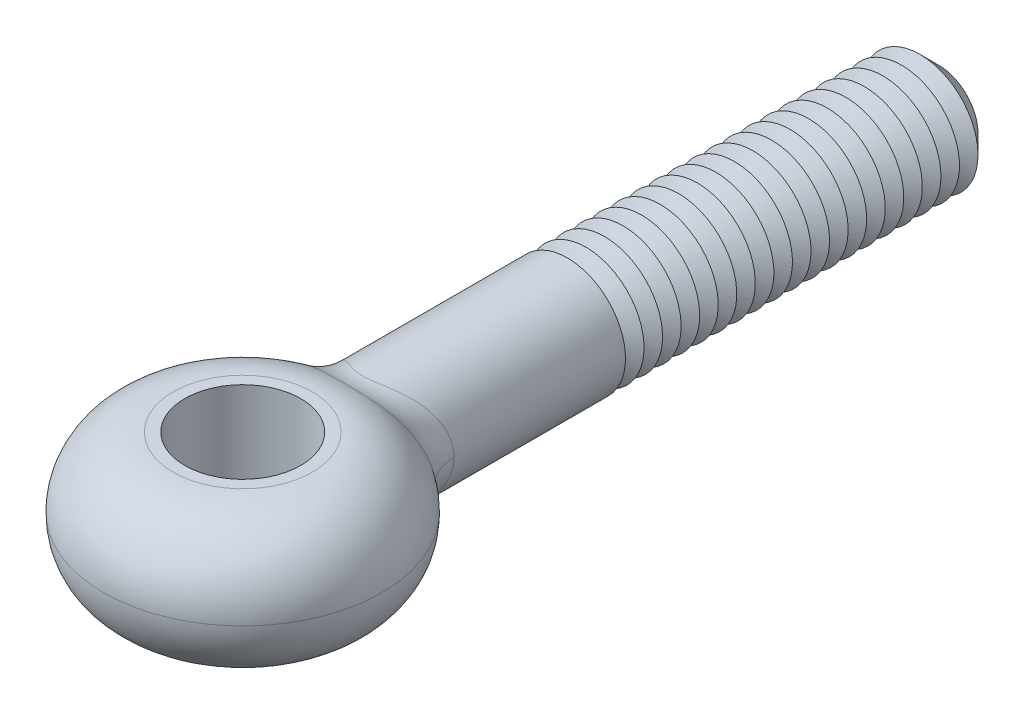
ISO-10303-21;
HEADER;
FILE_DESCRIPTION(('STEP AP214'),'2;1');
FILE_NAME('part.step','',(''),(''),'','','');
FILE_SCHEMA(('AUTOMOTIVE_DESIGN { 1 0 10303 214 1 1 1 1 }'));
ENDSEC;
DATA;
#1=APPLICATION_CONTEXT('core data for automotive mechanical design processes');
#2=APPLICATION_PROTOCOL_DEFINITION('international standard','automotive_design',2000,#1);
#3=PRODUCT_CONTEXT('',#1,'mechanical');
#4=PRODUCT('Part','Part','',(#3));
#5=PRODUCT_RELATED_PRODUCT_CATEGORY('part','',(#4));
#6=PRODUCT_DEFINITION_FORMATION('','',#4);
#7=PRODUCT_DEFINITION_CONTEXT('part definition',#1,'design');
#8=PRODUCT_DEFINITION('design','',#6,#7);
#9=PRODUCT_DEFINITION_SHAPE('','',#8);
#10=(LENGTH_UNIT() NAMED_UNIT(*) SI_UNIT(.MILLI.,.METRE.));
#11=(NAMED_UNIT(*) PLANE_ANGLE_UNIT() SI_UNIT($,.RADIAN.));
#12=(NAMED_UNIT(*) SI_UNIT($,.STERADIAN.) SOLID_ANGLE_UNIT());
#13=UNCERTAINTY_MEASURE_WITH_UNIT(LENGTH_MEASURE(1.E-05),#10,'distance_accuracy_value','');
#14=(GEOMETRIC_REPRESENTATION_CONTEXT(3) GLOBAL_UNCERTAINTY_ASSIGNED_CONTEXT((#13)) GLOBAL_UNIT_ASSIGNED_CONTEXT((#10,
#11,#12)) REPRESENTATION_CONTEXT('',''));
#15=CARTESIAN_POINT('',(0.,0.,0.));
#16=DIRECTION('',(0.,0.,1.));
#17=DIRECTION('',(1.,0.,0.));
#18=AXIS2_PLACEMENT_3D('',#15,#16,#17);
#19=CARTESIAN_POINT('',(0.,0.,-30.));
#20=DIRECTION('',(0.,0.,1.));
#21=DIRECTION('',(1.,0.,0.));
#22=AXIS2_PLACEMENT_3D('',#19,#20,#21);
#23=CYLINDRICAL_SURFACE('',#22,2.5);
#24=CARTESIAN_POINT('',(0.,0.,-14.));
#25=DIRECTION('',(0.,0.,-1.));
#26=DIRECTION('',(-1.,0.,0.));
#27=AXIS2_PLACEMENT_3D('',#24,#25,#26);
#28=CIRCLE('',#27,2.5);
#29=CARTESIAN_POINT('',(-2.5,0.,-14.));
#30=VERTEX_POINT('',#29);
#31=EDGE_CURVE('E79',#30,#30,#28,.T.);
#32=ORIENTED_EDGE('',*,*,#31,.F.);
#33=EDGE_LOOP('',(#32));
#34=FACE_BOUND('',#33,.T.);
#35=CARTESIAN_POINT('',(2.78341953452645,-1.59186120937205,-4.79327924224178));
#36=CARTESIAN_POINT('',(2.14571805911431,-1.30072530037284,-5.3743447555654));
#37=CARTESIAN_POINT('',(2.01927820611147,-1.47394556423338,-6.25925612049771));
#38=CARTESIAN_POINT('',(2.831703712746,-1.53469920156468,-4.80662089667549));
#39=CARTESIAN_POINT('',(2.1772769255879,-1.24792172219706,-5.3898625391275));
#40=CARTESIAN_POINT('',(2.05791099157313,-1.42101777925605,-6.2878456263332));
#41=CARTESIAN_POINT('',(2.87731821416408,-1.47574824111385,-4.81931887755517));
#42=CARTESIAN_POINT('',(2.20644442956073,-1.19462176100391,-5.40436026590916));
#43=CARTESIAN_POINT('',(2.09456285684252,-1.36643355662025,-6.31497994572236));
#44=CARTESIAN_POINT('',(2.96300366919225,-1.35453728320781,-4.8433013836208));
#45=CARTESIAN_POINT('',(2.26036740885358,-1.08700563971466,-5.43139492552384));
#46=CARTESIAN_POINT('',(2.16363788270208,-1.25420118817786,-6.36611531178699));
#47=CARTESIAN_POINT('',(3.00307308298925,-1.29227637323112,-4.85458551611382));
#48=CARTESIAN_POINT('',(2.28509247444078,-1.0327073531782,-5.44391770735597));
#49=CARTESIAN_POINT('',(2.19605986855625,-1.19655219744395,-6.39011548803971));
#50=CARTESIAN_POINT('',(3.11457798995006,-1.10105207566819,-4.88610560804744));
#51=CARTESIAN_POINT('',(2.35298983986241,-0.868493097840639,-5.47855834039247));
#52=CARTESIAN_POINT('',(2.28651645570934,-1.0194926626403,-6.45703286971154));
#53=CARTESIAN_POINT('',(3.17736416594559,-0.967583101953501,-4.90402434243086));
#54=CARTESIAN_POINT('',(2.38951585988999,-0.757939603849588,-5.49756398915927));
#55=CARTESIAN_POINT('',(2.33778513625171,-0.895910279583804,-6.49489913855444));
#56=CARTESIAN_POINT('',(3.2762931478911,-0.696845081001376,-4.93234966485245));
#57=CARTESIAN_POINT('',(2.44601304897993,-0.539370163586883,-5.52722187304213));
#58=CARTESIAN_POINT('',(2.41878010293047,-0.64522692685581,-6.55463771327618));
#59=CARTESIAN_POINT('',(3.31322228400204,-0.559833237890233,-4.94297774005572));
#60=CARTESIAN_POINT('',(2.46634024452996,-0.431613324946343,-5.53805203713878));
#61=CARTESIAN_POINT('',(2.44914166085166,-0.518364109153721,-6.57698187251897));
#62=CARTESIAN_POINT('',(3.36256644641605,-0.281879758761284,-4.95719210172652));
#63=CARTESIAN_POINT('',(2.49336316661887,-0.215769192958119,-5.55249569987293));
#64=CARTESIAN_POINT('',(2.48974403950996,-0.260999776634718,-6.60684652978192));
#65=CARTESIAN_POINT('',(3.37499961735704,-0.140941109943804,-4.96078360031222));
#66=CARTESIAN_POINT('',(2.49999900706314,-0.107956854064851,-5.55607731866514));
#67=CARTESIAN_POINT('',(2.49999975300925,-0.130501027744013,-6.61437799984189));
#68=CARTESIAN_POINT('',(3.37500038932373,0.143401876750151,-4.96078381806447));
#69=CARTESIAN_POINT('',(2.50000101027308,0.109841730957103,-5.55607819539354));
#70=CARTESIAN_POINT('',(2.50000025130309,0.132779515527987,-6.61437856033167));
#71=CARTESIAN_POINT('',(3.36213005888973,0.286806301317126,-4.9570660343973));
#72=CARTESIAN_POINT('',(2.49313362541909,0.21953405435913,-5.55237139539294));
#73=CARTESIAN_POINT('',(2.48938379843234,0.265561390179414,-6.60658237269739));
#74=CARTESIAN_POINT('',(3.31105376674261,0.569447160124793,-4.94235345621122));
#75=CARTESIAN_POINT('',(2.4651455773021,0.439127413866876,-5.53741516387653));
#76=CARTESIAN_POINT('',(2.44735853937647,0.527265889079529,-6.57566949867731));
#77=CARTESIAN_POINT('',(3.2728375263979,0.708681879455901,-4.93135570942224));
#78=CARTESIAN_POINT('',(2.44409422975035,0.548739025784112,-5.52620260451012));
#79=CARTESIAN_POINT('',(2.41594129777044,0.656186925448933,-6.55254659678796));
#80=CARTESIAN_POINT('',(3.17230532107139,0.978796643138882,-4.90258103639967));
#81=CARTESIAN_POINT('',(2.3865722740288,0.767190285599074,-5.4960319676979));
#82=CARTESIAN_POINT('',(2.33365404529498,0.906293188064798,-6.49184951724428));
#83=CARTESIAN_POINT('',(3.11002745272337,1.10968951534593,-4.88481482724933));
#84=CARTESIAN_POINT('',(2.35027184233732,0.875780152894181,-5.47716086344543));
#85=CARTESIAN_POINT('',(2.28281478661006,1.02749029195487,-6.45429818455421));
#86=CARTESIAN_POINT('',(2.96306047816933,1.36001779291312,-4.84327946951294));
#87=CARTESIAN_POINT('',(2.26083780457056,1.09062442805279,-5.43155444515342));
#88=CARTESIAN_POINT('',(2.163610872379,1.25927573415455,-6.36610676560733));
#89=CARTESIAN_POINT('',(2.87837355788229,1.47945431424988,-4.81951090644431));
#90=CARTESIAN_POINT('',(2.20790880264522,1.19669657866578,-5.40491826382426));
#91=CARTESIAN_POINT('',(2.0952479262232,1.36986510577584,-6.31546795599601));
#92=CARTESIAN_POINT('',(2.68558517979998,1.7076778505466,-4.76625186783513));
#93=CARTESIAN_POINT('',(2.08220250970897,1.40697007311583,-5.34311996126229));
#94=CARTESIAN_POINT('',(1.94100402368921,1.58118319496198,-6.20133915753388));
#95=CARTESIAN_POINT('',(2.57685139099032,1.8160319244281,-4.73660969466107));
#96=CARTESIAN_POINT('',(2.00910730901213,1.51094837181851,-5.30782806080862));
#97=CARTESIAN_POINT('',(1.85465458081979,1.68151104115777,-6.13750593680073));
#98=CARTESIAN_POINT('',(2.33928032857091,2.01584554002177,-4.67361867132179));
#99=CARTESIAN_POINT('',(1.84304754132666,1.71007551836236,-5.23013197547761));
#100=CARTESIAN_POINT('',(1.66833418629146,1.86652364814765,-6.00086530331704));
#101=CARTESIAN_POINT('',(2.21043096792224,2.10729485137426,-4.64026759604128));
#102=CARTESIAN_POINT('',(1.75031966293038,1.8052391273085,-5.18781856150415));
#103=CARTESIAN_POINT('',(1.56835504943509,1.95119893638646,-5.92805250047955));
#104=CARTESIAN_POINT('',(1.99751216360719,2.23394098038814,-4.58780602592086));
#105=CARTESIAN_POINT('',(1.59194994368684,1.94203878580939,-5.11897301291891));
#106=CARTESIAN_POINT('',(1.4058468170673,2.06846387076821,-5.81257645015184));
#107=CARTESIAN_POINT('',(1.92009823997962,2.2756671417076,-4.56919966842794));
#108=CARTESIAN_POINT('',(1.5336987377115,1.98802800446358,-5.09422592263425));
#109=CARTESIAN_POINT('',(1.34723871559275,2.10709920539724,-5.77144648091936));
#110=CARTESIAN_POINT('',(1.75973784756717,2.35363226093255,-4.53203912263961));
#111=CARTESIAN_POINT('',(1.41145270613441,2.0755845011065,-5.04404873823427));
#112=CARTESIAN_POINT('',(1.22703303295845,2.17928913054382,-5.68893121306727));
#113=CARTESIAN_POINT('',(1.6767929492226,2.38987276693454,-4.51348492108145));
#114=CARTESIAN_POINT('',(1.3474791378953,2.11718338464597,-5.01861818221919));
#115=CARTESIAN_POINT('',(1.16543630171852,2.21284515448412,-5.6475459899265));
#116=CARTESIAN_POINT('',(1.5051830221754,2.45675134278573,-4.47701205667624));
#117=CARTESIAN_POINT('',(1.21372799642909,2.19531106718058,-4.96793801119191));
#118=CARTESIAN_POINT('',(1.03940209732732,2.27476976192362,-5.5658219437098));
#119=CARTESIAN_POINT('',(1.41651302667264,2.48738445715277,-4.45909396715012));
#120=CARTESIAN_POINT('',(1.14395137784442,2.23187357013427,-4.94267911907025));
#121=CARTESIAN_POINT('',(0.974962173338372,2.30313375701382,-5.52548407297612));
#122=CARTESIAN_POINT('',(1.2334267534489,2.54282715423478,-4.4247261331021));
#123=CARTESIAN_POINT('',(0.998757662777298,2.29910433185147,-4.89365860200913));
#124=CARTESIAN_POINT('',(0.843479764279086,2.35446958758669,-5.44777655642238));
#125=CARTESIAN_POINT('',(1.13901258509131,2.56763885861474,-4.40827585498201));
#126=CARTESIAN_POINT('',(0.923330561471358,2.32981830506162,-4.86987717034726));
#127=CARTESIAN_POINT('',(0.77643823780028,2.37744338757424,-5.41040583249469));
#128=CARTESIAN_POINT('',(0.906301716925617,2.6196969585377,-4.37198138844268));
#129=CARTESIAN_POINT('',(0.736578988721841,2.39507218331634,-4.81694956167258));
#130=CARTESIAN_POINT('',(0.613199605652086,2.42564533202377,-5.32763271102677));
#131=CARTESIAN_POINT('',(0.765194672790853,2.6441512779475,-4.35329767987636));
#132=CARTESIAN_POINT('',(0.622406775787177,2.42664265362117,-4.78918338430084));
#133=CARTESIAN_POINT('',(0.515784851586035,2.44828822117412,-5.28474181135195));
#134=CARTESIAN_POINT('',(0.546606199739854,2.67131287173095,-4.33168473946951));
#135=CARTESIAN_POINT('',(0.444918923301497,2.46206701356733,-4.756847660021));
#136=CARTESIAN_POINT('',(0.366917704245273,2.47343784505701,-5.23496757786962));
#137=CARTESIAN_POINT('',(0.472728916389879,2.67877512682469,-4.3255545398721));
#138=CARTESIAN_POINT('',(0.384868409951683,2.47188464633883,-4.74762646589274));
#139=CARTESIAN_POINT('',(0.316930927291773,2.4803473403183,-5.22081573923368));
#140=CARTESIAN_POINT('',(0.323225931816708,2.69043587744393,-4.31584469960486));
#141=CARTESIAN_POINT('',(0.263268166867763,2.48727604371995,-4.7329952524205));
#142=CARTESIAN_POINT('',(0.21623936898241,2.49114433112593,-5.19837742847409));
#143=CARTESIAN_POINT('',(0.24760125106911,2.69463623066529,-4.31226360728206));
#144=CARTESIAN_POINT('',(0.201683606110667,2.49286186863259,-4.72757415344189));
#145=CARTESIAN_POINT('',(0.165535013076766,2.49503354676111,-5.19008761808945));
#146=CARTESIAN_POINT('',(0.094861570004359,2.69970310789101,-4.30793149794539));
#147=CARTESIAN_POINT('',(0.0772955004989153,2.49960079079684,-4.72101731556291));
#148=CARTESIAN_POINT('',(0.0633454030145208,2.49972510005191,-5.18005710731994));
#149=CARTESIAN_POINT('',(0.017739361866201,2.70054092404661,-4.30720485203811));
#150=CARTESIAN_POINT('',(0.0144434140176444,2.50072036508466,-4.71991397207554));
#151=CARTESIAN_POINT('',(0.0118571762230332,2.500500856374,-5.17837280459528));
#152=CARTESIAN_POINT('',(-0.136203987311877,2.69878264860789,-4.30871632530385));
#153=CARTESIAN_POINT('',(-0.110955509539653,2.49837825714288,-4.72220376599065));
#154=CARTESIAN_POINT('',(-0.0909950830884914,2.49887282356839,-5.18187386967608));
#155=CARTESIAN_POINT('',(-0.213025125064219,2.69618651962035,-4.31095447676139));
#156=CARTESIAN_POINT('',(-0.173546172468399,2.49491488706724,-4.72559855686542));
#157=CARTESIAN_POINT('',(-0.142359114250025,2.49646899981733,-5.18705931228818));
#158=CARTESIAN_POINT('',(-0.36553597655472,2.68761038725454,-4.31820554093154));
#159=CARTESIAN_POINT('',(-0.297684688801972,2.48354513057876,-4.73655288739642));
#160=CARTESIAN_POINT('',(-0.244685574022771,2.48852813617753,-5.20383450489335));
#161=CARTESIAN_POINT('',(-0.441220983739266,2.6816189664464,-4.32322781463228));
#162=CARTESIAN_POINT('',(-0.359268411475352,2.47561613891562,-4.74413371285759));
#163=CARTESIAN_POINT('',(-0.295646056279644,2.48298052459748,-5.21544586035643));
#164=CARTESIAN_POINT('',(-0.590415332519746,2.6663656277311,-4.33565461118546));
#165=CARTESIAN_POINT('',(-0.480475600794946,2.4556075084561,-4.76278791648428));
#166=CARTESIAN_POINT('',(-0.396672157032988,2.46885706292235,-5.24411576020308));
#167=CARTESIAN_POINT('',(-0.663923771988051,2.65710237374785,-4.34306010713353));
#168=CARTESIAN_POINT('',(-0.540131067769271,2.44351406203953,-4.77387344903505));
#169=CARTESIAN_POINT('',(-0.44673740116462,2.46027997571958,-5.26117652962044));
#170=CARTESIAN_POINT('',(-0.831352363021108,2.63198098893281,-4.36244332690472));
#171=CARTESIAN_POINT('',(-0.675735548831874,2.41105829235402,-4.80270108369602));
#172=CARTESIAN_POINT('',(-0.561587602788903,2.43701943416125,-5.30571455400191));
#173=CARTESIAN_POINT('',(-0.924289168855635,2.6149613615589,-4.37512591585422));
#174=CARTESIAN_POINT('',(-0.750790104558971,2.38927243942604,-4.82144973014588));
#175=CARTESIAN_POINT('',(-0.625964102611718,2.42126052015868,-5.33477828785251));
#176=CARTESIAN_POINT('',(-1.10516352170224,2.57574008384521,-4.40274397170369));
#177=CARTESIAN_POINT('',(-0.89617727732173,2.33992937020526,-4.86182815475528));
#178=CARTESIAN_POINT('',(-0.752583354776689,2.38494452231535,-5.39780912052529));
#179=CARTESIAN_POINT('',(-1.19309918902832,2.55353650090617,-4.41768027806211));
#180=CARTESIAN_POINT('',(-0.966539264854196,2.31233373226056,-4.88348226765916));
#181=CARTESIAN_POINT('',(-0.814825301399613,2.36438564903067,-5.43177804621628));
#182=CARTESIAN_POINT('',(-1.36408592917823,2.50411967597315,-4.44895154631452));
#183=CARTESIAN_POINT('',(-1.10247087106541,2.25205127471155,-4.92826951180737));
#184=CARTESIAN_POINT('',(-0.937136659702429,2.31862932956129,-5.50258991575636));
#185=CARTESIAN_POINT('',(-1.4471314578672,2.47690088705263,-4.46528804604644));
#186=CARTESIAN_POINT('',(-1.16804717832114,2.21932398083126,-4.95142074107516));
#187=CARTESIAN_POINT('',(-0.997203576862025,2.29342674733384,-5.53943601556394));
#188=CARTESIAN_POINT('',(-1.60835015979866,2.41761835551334,-4.49866880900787));
#189=CARTESIAN_POINT('',(-1.29428986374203,2.14941948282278,-4.99811371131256));
#190=CARTESIAN_POINT('',(-1.11497966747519,2.23853551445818,-5.61439808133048));
#191=CARTESIAN_POINT('',(-1.68652398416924,2.38555526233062,-4.51571297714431));
#192=CARTESIAN_POINT('',(-1.3549551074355,2.11221158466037,-5.02166467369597));
#193=CARTESIAN_POINT('',(-1.17268915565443,2.20884746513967,-5.65251387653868));
#194=CARTESIAN_POINT('',(-1.84102679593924,2.31537342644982,-4.55065121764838));
#195=CARTESIAN_POINT('',(-1.47363936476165,2.03237790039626,-5.06928809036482));
#196=CARTESIAN_POINT('',(-1.28777958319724,2.1438642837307,-5.73031643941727));
#197=CARTESIAN_POINT('',(-1.91717041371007,2.27706976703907,-4.56855283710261));
#198=CARTESIAN_POINT('',(-1.5314431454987,1.98957796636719,-5.09334433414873));
#199=CARTESIAN_POINT('',(-1.34506326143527,2.10839793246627,-5.77000745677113));
#200=CARTESIAN_POINT('',(-2.06435914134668,2.19549414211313,-4.60411592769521));
#201=CARTESIAN_POINT('',(-1.64179513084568,1.90033354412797,-5.14043913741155));
#202=CARTESIAN_POINT('',(-1.45671149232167,2.03286494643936,-5.84853073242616));
#203=CARTESIAN_POINT('',(-2.13540269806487,2.15222067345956,-4.62177732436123));
#204=CARTESIAN_POINT('',(-1.69431856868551,1.85386594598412,-5.16347382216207));
#205=CARTESIAN_POINT('',(-1.51107515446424,1.99279691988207,-5.88736272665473));
#206=CARTESIAN_POINT('',(-2.34062893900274,2.01525525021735,-4.67380595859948));
#207=CARTESIAN_POINT('',(-1.84426716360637,1.70956328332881,-5.23047721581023));
#208=CARTESIAN_POINT('',(-1.66923732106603,1.86597708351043,-6.00131438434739));
#209=CARTESIAN_POINT('',(-2.46717911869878,1.91429396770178,-4.70728175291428));
#210=CARTESIAN_POINT('',(-1.93332878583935,1.60734351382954,-5.27203498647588));
#211=CARTESIAN_POINT('',(-1.76831121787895,1.7724944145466,-6.07403221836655));
#212=CARTESIAN_POINT('',(-2.70679041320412,1.68661240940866,-4.77193962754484));
#213=CARTESIAN_POINT('',(-2.09686028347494,1.38674049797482,-5.35007469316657));
#214=CARTESIAN_POINT('',(-1.95773190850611,1.56167815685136,-6.21363092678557));
#215=CARTESIAN_POINT('',(-2.81813452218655,1.55853025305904,-4.80276284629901));
#216=CARTESIAN_POINT('',(-2.16933176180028,1.26784061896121,-5.38577211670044));
#217=CARTESIAN_POINT('',(-2.04687161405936,1.44308356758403,-6.27966835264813));
#218=CARTESIAN_POINT('',(-3.01261219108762,1.28525500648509,-4.85717783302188));
#219=CARTESIAN_POINT('',(-2.29190513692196,1.02488048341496,-5.44718873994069));
#220=CARTESIAN_POINT('',(-2.20361102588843,1.19005093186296,-6.39571302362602));
#221=CARTESIAN_POINT('',(-3.09572994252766,1.14005238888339,-4.8807655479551));
#222=CARTESIAN_POINT('',(-2.34165620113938,0.901027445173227,-5.47274428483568));
#223=CARTESIAN_POINT('',(-2.27119866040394,1.05560406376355,-6.44571128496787));
#224=CARTESIAN_POINT('',(-3.22543031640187,0.849553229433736,-4.91775305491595));
#225=CARTESIAN_POINT('',(-2.41740189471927,0.661472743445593,-5.51211129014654));
#226=CARTESIAN_POINT('',(-2.37706331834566,0.786623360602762,-6.5238938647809));
#227=CARTESIAN_POINT('',(-3.27441877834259,0.705208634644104,-4.93182105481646));
#228=CARTESIAN_POINT('',(-2.44479989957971,0.546140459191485,-5.52660885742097));
#229=CARTESIAN_POINT('',(-2.41726455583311,0.652970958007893,-6.55351221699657));
#230=CARTESIAN_POINT('',(-3.3444386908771,0.410725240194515,-4.95196114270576));
#231=CARTESIAN_POINT('',(-2.48358904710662,0.315091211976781,-5.54724099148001));
#232=CARTESIAN_POINT('',(-2.47480549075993,0.380301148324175,-6.59586878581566));
#233=CARTESIAN_POINT('',(-3.365557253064,0.260606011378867,-4.95805814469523));
#234=CARTESIAN_POINT('',(-2.49491680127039,0.199701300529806,-5.55334192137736));
#235=CARTESIAN_POINT('',(-2.49221642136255,0.241301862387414,-6.6086595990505));
#236=CARTESIAN_POINT('',(-3.3741611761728,0.0734663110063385,-4.96054177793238));
#237=CARTESIAN_POINT('',(-2.49954473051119,0.0562665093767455,-5.55583336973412));
#238=CARTESIAN_POINT('',(-2.49930902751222,0.06802436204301,-6.61387040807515));
#239=CARTESIAN_POINT('',(-3.37500321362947,0.0367413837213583,-4.9607847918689));
#240=CARTESIAN_POINT('',(-2.49999869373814,0.0281412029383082,-5.55607760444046));
#241=CARTESIAN_POINT('',(-2.50000304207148,0.0340197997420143,-6.61438032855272));
#242=CARTESIAN_POINT('',(-3.37498749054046,-0.143020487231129,-4.9607794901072));
#243=CARTESIAN_POINT('',(-2.50000508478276,-0.109543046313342,-5.55607833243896));
#244=CARTESIAN_POINT('',(-2.49998815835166,-0.132426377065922,-6.61437029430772));
#245=CARTESIAN_POINT('',(-3.36216727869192,-0.286290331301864,-4.9570765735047));
#246=CARTESIAN_POINT('',(-2.49315564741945,-0.219138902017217,-5.55238275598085));
#247=CARTESIAN_POINT('',(-2.48941413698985,-0.265083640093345,-6.60660464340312));
#248=CARTESIAN_POINT('',(-3.31118832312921,-0.5690125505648,-4.94239239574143));
#249=CARTESIAN_POINT('',(-2.46521750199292,-0.438784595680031,-5.53745400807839));
#250=CARTESIAN_POINT('',(-2.44746953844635,-0.526863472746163,-6.57575118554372));
#251=CARTESIAN_POINT('',(-3.2729343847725,-0.708448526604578,-4.93138379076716));
#252=CARTESIAN_POINT('',(-2.44415038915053,-0.548545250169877,-5.5262324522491));
#253=CARTESIAN_POINT('',(-2.41602083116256,-0.65597085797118,-6.55260581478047));
#254=CARTESIAN_POINT('',(-3.172210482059,-0.979024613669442,-4.90255353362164));
#255=CARTESIAN_POINT('',(-2.38651784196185,-0.767377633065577,-5.49600302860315));
#256=CARTESIAN_POINT('',(-2.3335761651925,-0.906504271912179,-6.49179151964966));
#257=CARTESIAN_POINT('',(-3.10977969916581,-1.11017775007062,-4.88474290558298));
#258=CARTESIAN_POINT('',(-2.35012430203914,-0.876197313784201,-5.47708301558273));
#259=CARTESIAN_POINT('',(-2.28261183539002,-1.0279423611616,-6.45414609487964));
#260=CARTESIAN_POINT('',(-2.99946679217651,-1.29797370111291,-4.85356946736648));
#261=CARTESIAN_POINT('',(-2.28287045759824,-1.0376648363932,-5.44279118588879));
#262=CARTESIAN_POINT('',(-2.19314078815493,-1.2018275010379,-6.3879550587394));
#263=CARTESIAN_POINT('',(-2.95997615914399,-1.35901454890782,-4.84245162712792));
#264=CARTESIAN_POINT('',(-2.25847709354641,-1.0909506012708,-5.43044281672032));
#265=CARTESIAN_POINT('',(-2.16119309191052,-1.25834680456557,-6.36430554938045));
#266=CARTESIAN_POINT('',(-2.87565347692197,-1.4778979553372,-4.81885538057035));
#267=CARTESIAN_POINT('',(-2.20537734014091,-1.19657026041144,-5.40382980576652));
#268=CARTESIAN_POINT('',(-2.09322519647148,-1.36842403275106,-6.31398947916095));
#269=CARTESIAN_POINT('',(-2.83082295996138,-1.53574142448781,-4.8063773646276));
#270=CARTESIAN_POINT('',(-2.17669982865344,-1.24888735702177,-5.38957859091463));
#271=CARTESIAN_POINT('',(-2.05720616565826,-1.42198280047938,-6.2873237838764));
#272=CARTESIAN_POINT('',(-2.78341953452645,-1.59186120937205,-4.79327924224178));
#273=CARTESIAN_POINT('',(-2.14571805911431,-1.30072530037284,-5.3743447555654));
#274=CARTESIAN_POINT('',(-2.01927820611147,-1.47394556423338,-6.25925612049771));
#275=(BOUNDED_SURFACE() B_SPLINE_SURFACE(3,2,((#35,#36,#37),(#38,#39,#40),(#41,#42,#43),(#44,
#45,#46),(#47,#48,#49),(#50,#51,#52),(#53,#54,#55),(#56,#57,#58),(#59,#60,#61),(#62,#63,#64),
(#65,#66,#67),(#68,#69,#70),(#71,#72,#73),(#74,#75,#76),(#77,#78,#79),(#80,#81,#82),(#83,#84,
#85),(#86,#87,#88),(#89,#90,#91),(#92,#93,#94),(#95,#96,#97),(#98,#99,#100),(#101,#102,#103),
(#104,#105,#106),(#107,#108,#109),(#110,#111,#112),(#113,#114,#115),(#116,#117,#118),(#119,#120,
#121),(#122,#123,#124),(#125,#126,#127),(#128,#129,#130),(#131,#132,#133),(#134,#135,#136),
(#137,#138,#139),(#140,#141,#142),(#143,#144,#145),(#146,#147,#148),(#149,#150,#151),(#152,#153,
#154),(#155,#156,#157),(#158,#159,#160),(#161,#162,#163),(#164,#165,#166),(#167,#168,#169),
(#170,#171,#172),(#173,#174,#175),(#176,#177,#178),(#179,#180,#181),(#182,#183,#184),(#185,#186,
#187),(#188,#189,#190),(#191,#192,#193),(#194,#195,#196),(#197,#198,#199),(#200,#201,#202),
(#203,#204,#205),(#206,#207,#208),(#209,#210,#211),(#212,#213,#214),(#215,#216,#217),(#218,#219,
#220),(#221,#222,#223),(#224,#225,#226),(#227,#228,#229),(#230,#231,#232),(#233,#234,#235),
(#236,#237,#238),(#239,#240,#241),(#242,#243,#244),(#245,#246,#247),(#248,#249,#250),(#251,#252,
#253),(#254,#255,#256),(#257,#258,#259),(#260,#261,#262),(#263,#264,#265),(#266,#267,#268),
(#269,#270,#271),(#272,#273,#274)),.UNSPECIFIED.,.F.,.F.,.F.) B_SPLINE_SURFACE_WITH_KNOTS((4,2,
2,2,2,2,2,2,2,2,2,2,2,2,2,2,2,2,2,2,2,2,2,2,2,2,2,2,2,2,2,2,2,2,2,2,2,2,2,4),(3,3),(0.,
0.363898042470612,0.727896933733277,1.45549120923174,2.15986563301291,2.86371811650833,
3.57985953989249,4.2962915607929,5.01159387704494,5.72682644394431,6.46375484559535,
7.20112776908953,7.5994115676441,7.99758275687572,8.39610414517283,8.79448006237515,
9.34746095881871,9.62295413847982,9.89829030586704,10.175972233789,10.4536571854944,
10.7322815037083,11.0110197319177,11.3788266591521,11.7467709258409,12.1151246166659,
12.4834289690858,12.8658412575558,13.2483695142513,14.0121043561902,14.8329658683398,
15.6542863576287,16.4093703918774,17.1620886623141,17.3457541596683,18.060695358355,
18.7783276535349,19.4948017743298,19.8521704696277,20.2094368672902),(0.,1.),
.UNSPECIFIED.) GEOMETRIC_REPRESENTATION_ITEM() RATIONAL_B_SPLINE_SURFACE(((1.,0.91012003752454,
1.),(1.,0.908112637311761,1.),(1.,0.906182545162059,1.),(1.,0.902507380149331,1.),(1.,
0.900762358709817,1.),(1.,0.895853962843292,1.),(1.,0.8930149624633,1.),(1.,0.888491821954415,
1.),(1.,0.886773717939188,1.),(1.,0.884469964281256,1.),(1.,0.883883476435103,1.),(1.,
0.883883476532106,1.),(1.,0.884490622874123,1.),(1.,0.886874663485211,1.),(1.,0.888652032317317,
1.),(1.,0.893243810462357,1.),(1.,0.896056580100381,1.),(1.,0.902521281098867,1.),(1.,
0.906173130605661,1.),(1.,0.914186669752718,1.),(1.,0.918566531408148,1.),(1.,0.927642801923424,
1.),(1.,0.932339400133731,1.),(1.,0.939527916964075,1.),(1.,0.942040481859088,1.),(1.,
0.946983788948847,1.),(1.,0.949414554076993,1.),(1.,0.954120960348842,1.),(1.,0.95639646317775,
1.),(1.,0.960697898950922,1.),(1.,0.962723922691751,1.),(1.,0.967135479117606,1.),(1.,
0.969355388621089,1.),(1.,0.971895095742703,1.),(1.,0.972609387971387,1.),(1.,0.973736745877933,
1.),(1.,0.974149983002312,1.),(1.,0.974649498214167,1.),(1.,0.974732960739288,1.),(1.,
0.974558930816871,1.),(1.,0.974301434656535,1.),(1.,0.973462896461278,1.),(1.,0.972880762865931,
1.),(1.,0.971429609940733,1.),(1.,0.970560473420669,1.),(1.,0.968264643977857,1.),(1.,
0.966748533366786,1.),(1.,0.963399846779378,1.),(1.,0.961567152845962,1.),(1.,0.957673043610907,
1.),(1.,0.955611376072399,1.),(1.,0.951336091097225,1.),(1.,0.949122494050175,1.),(1.,
0.944519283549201,1.),(1.,0.942126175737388,1.),(1.,0.937304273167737,1.),(1.,0.934875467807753,
1.),(1.,0.92762365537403,1.),(1.,0.922826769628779,1.),(1.,0.913355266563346,1.),(1.,
0.908716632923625,1.),(1.,0.900383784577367,1.),(1.,0.896690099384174,1.),(1.,0.890834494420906,
1.),(1.,0.888573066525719,1.),(1.,0.885321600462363,1.),(1.,0.88432760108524,1.),(1.,
0.883922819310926,1.),(1.,0.883883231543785,1.),(1.,0.883884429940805,1.),(1.,0.884488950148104,
1.),(1.,0.886868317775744,1.),(1.,0.88864756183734,1.),(1.,0.893248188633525,1.),(1.,
0.896067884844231,1.),(1.,0.900919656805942,1.),(1.,0.902638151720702,1.),(1.,0.906252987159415,
1.),(1.,0.908149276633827,1.),(1.,0.91012003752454,1.))) REPRESENTATION_ITEM('') SURFACE());
#276=CARTESIAN_POINT('',(-2.01927820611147,-1.47394556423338,-6.25925612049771));
#277=CARTESIAN_POINT('',(-2.05720616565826,-1.42198280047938,-6.2873237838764));
#278=CARTESIAN_POINT('',(-2.09322519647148,-1.36842403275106,-6.31398947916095));
#279=CARTESIAN_POINT('',(-2.16119309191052,-1.25834680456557,-6.36430554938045));
#280=CARTESIAN_POINT('',(-2.19314078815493,-1.2018275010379,-6.3879550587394));
#281=CARTESIAN_POINT('',(-2.28261183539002,-1.0279423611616,-6.45414609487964));
#282=CARTESIAN_POINT('',(-2.3335761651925,-0.906504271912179,-6.49179151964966));
#283=CARTESIAN_POINT('',(-2.41602083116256,-0.655970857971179,-6.55260581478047));
#284=CARTESIAN_POINT('',(-2.44746953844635,-0.526863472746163,-6.57575118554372));
#285=CARTESIAN_POINT('',(-2.48941413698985,-0.265083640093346,-6.60660464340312));
#286=CARTESIAN_POINT('',(-2.49998815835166,-0.132426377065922,-6.61437029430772));
#287=CARTESIAN_POINT('',(-2.50000304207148,0.0340197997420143,-6.61438032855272));
#288=CARTESIAN_POINT('',(-2.49930902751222,0.0680243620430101,-6.61387040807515));
#289=CARTESIAN_POINT('',(-2.49221642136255,0.241301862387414,-6.6086595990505));
#290=CARTESIAN_POINT('',(-2.47480549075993,0.380301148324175,-6.59586878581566));
#291=CARTESIAN_POINT('',(-2.41726455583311,0.652970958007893,-6.55351221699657));
#292=CARTESIAN_POINT('',(-2.37706331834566,0.786623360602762,-6.5238938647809));
#293=CARTESIAN_POINT('',(-2.27119866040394,1.05560406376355,-6.44571128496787));
#294=CARTESIAN_POINT('',(-2.20361102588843,1.19005093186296,-6.39571302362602));
#295=CARTESIAN_POINT('',(-2.04687161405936,1.44308356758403,-6.27966835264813));
#296=CARTESIAN_POINT('',(-1.95773190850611,1.56167815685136,-6.21363092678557));
#297=CARTESIAN_POINT('',(-1.76831121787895,1.7724944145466,-6.07403221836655));
#298=CARTESIAN_POINT('',(-1.66923732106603,1.86597708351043,-6.00131438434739));
#299=CARTESIAN_POINT('',(-1.51107515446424,1.99279691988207,-5.88736272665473));
#300=CARTESIAN_POINT('',(-1.45671149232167,2.03286494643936,-5.84853073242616));
#301=CARTESIAN_POINT('',(-1.34506326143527,2.10839793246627,-5.77000745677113));
#302=CARTESIAN_POINT('',(-1.28777958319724,2.1438642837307,-5.73031643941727));
#303=CARTESIAN_POINT('',(-1.17268915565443,2.20884746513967,-5.65251387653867));
#304=CARTESIAN_POINT('',(-1.11497966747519,2.23853551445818,-5.61439808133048));
#305=CARTESIAN_POINT('',(-0.997203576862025,2.29342674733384,-5.53943601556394));
#306=CARTESIAN_POINT('',(-0.937136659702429,2.31862932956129,-5.50258991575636));
#307=CARTESIAN_POINT('',(-0.814825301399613,2.36438564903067,-5.43177804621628));
#308=CARTESIAN_POINT('',(-0.752583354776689,2.38494452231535,-5.39780912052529));
#309=CARTESIAN_POINT('',(-0.625964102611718,2.42126052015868,-5.33477828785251));
#310=CARTESIAN_POINT('',(-0.561587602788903,2.43701943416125,-5.30571455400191));
#311=CARTESIAN_POINT('',(-0.44673740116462,2.46027997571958,-5.26117652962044));
#312=CARTESIAN_POINT('',(-0.396672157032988,2.46885706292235,-5.24411576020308));
#313=CARTESIAN_POINT('',(-0.295646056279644,2.48298052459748,-5.21544586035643));
#314=CARTESIAN_POINT('',(-0.244685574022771,2.48852813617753,-5.20383450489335));
#315=CARTESIAN_POINT('',(-0.142359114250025,2.49646899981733,-5.18705931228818));
#316=CARTESIAN_POINT('',(-0.0909950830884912,2.49887282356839,-5.18187386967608));
#317=CARTESIAN_POINT('',(0.0118571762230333,2.500500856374,-5.17837280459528));
#318=CARTESIAN_POINT('',(0.0633454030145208,2.49972510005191,-5.18005710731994));
#319=CARTESIAN_POINT('',(0.165535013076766,2.49503354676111,-5.19008761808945));
#320=CARTESIAN_POINT('',(0.21623936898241,2.49114433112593,-5.19837742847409));
#321=CARTESIAN_POINT('',(0.316930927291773,2.4803473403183,-5.22081573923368));
#322=CARTESIAN_POINT('',(0.366917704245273,2.47343784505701,-5.23496757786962));
#323=CARTESIAN_POINT('',(0.515784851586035,2.44828822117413,-5.28474181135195));
#324=CARTESIAN_POINT('',(0.613199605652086,2.42564533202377,-5.32763271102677));
#325=CARTESIAN_POINT('',(0.77643823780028,2.37744338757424,-5.41040583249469));
#326=CARTESIAN_POINT('',(0.843479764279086,2.35446958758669,-5.44777655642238));
#327=CARTESIAN_POINT('',(0.974962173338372,2.30313375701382,-5.52548407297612));
#328=CARTESIAN_POINT('',(1.03940209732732,2.27476976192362,-5.5658219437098));
#329=CARTESIAN_POINT('',(1.16543630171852,2.21284515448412,-5.6475459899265));
#330=CARTESIAN_POINT('',(1.22703303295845,2.17928913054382,-5.68893121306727));
#331=CARTESIAN_POINT('',(1.34723871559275,2.10709920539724,-5.77144648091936));
#332=CARTESIAN_POINT('',(1.4058468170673,2.06846387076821,-5.81257645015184));
#333=CARTESIAN_POINT('',(1.56835504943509,1.95119893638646,-5.92805250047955));
#334=CARTESIAN_POINT('',(1.66833418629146,1.86652364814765,-6.00086530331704));
#335=CARTESIAN_POINT('',(1.85465458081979,1.68151104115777,-6.13750593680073));
#336=CARTESIAN_POINT('',(1.94100402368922,1.58118319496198,-6.20133915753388));
#337=CARTESIAN_POINT('',(2.0952479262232,1.36986510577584,-6.31546795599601));
#338=CARTESIAN_POINT('',(2.163610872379,1.25927573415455,-6.36610676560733));
#339=CARTESIAN_POINT('',(2.28281478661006,1.02749029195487,-6.45429818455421));
#340=CARTESIAN_POINT('',(2.33365404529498,0.906293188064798,-6.49184951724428));
#341=CARTESIAN_POINT('',(2.41594129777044,0.656186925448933,-6.55254659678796));
#342=CARTESIAN_POINT('',(2.44735853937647,0.52726588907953,-6.57566949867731));
#343=CARTESIAN_POINT('',(2.48938379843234,0.265561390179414,-6.60658237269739));
#344=CARTESIAN_POINT('',(2.50000025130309,0.132779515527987,-6.61437856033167));
#345=CARTESIAN_POINT('',(2.49999975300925,-0.130501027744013,-6.61437799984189));
#346=CARTESIAN_POINT('',(2.48974403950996,-0.260999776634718,-6.60684652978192));
#347=CARTESIAN_POINT('',(2.44914166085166,-0.518364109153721,-6.57698187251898));
#348=CARTESIAN_POINT('',(2.41878010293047,-0.64522692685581,-6.55463771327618));
#349=CARTESIAN_POINT('',(2.33778513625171,-0.895910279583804,-6.49489913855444));
#350=CARTESIAN_POINT('',(2.28651645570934,-1.0194926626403,-6.45703286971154));
#351=CARTESIAN_POINT('',(2.19605986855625,-1.19655219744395,-6.39011548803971));
#352=CARTESIAN_POINT('',(2.16363788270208,-1.25420118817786,-6.36611531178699));
#353=CARTESIAN_POINT('',(2.09456285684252,-1.36643355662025,-6.31497994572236));
#354=CARTESIAN_POINT('',(2.05791099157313,-1.42101777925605,-6.2878456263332));
#355=CARTESIAN_POINT('',(2.01927820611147,-1.47394556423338,-6.25925612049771));
#356=B_SPLINE_CURVE_WITH_KNOTS('',3,(#276,#277,#278,#279,#280,#281,#282,#283,#284,#285,#286,
#287,#288,#289,#290,#291,#292,#293,#294,#295,#296,#297,#298,#299,#300,#301,#302,#303,#304,#305,
#306,#307,#308,#309,#310,#311,#312,#313,#314,#315,#316,#317,#318,#319,#320,#321,#322,#323,#324,
#325,#326,#327,#328,#329,#330,#331,#332,#333,#334,#335,#336,#337,#338,#339,#340,#341,#342,#343,
#344,#345,#346,#347,#348,#349,#350,#351,#352,#353,#354,#355),.UNSPECIFIED.,.F.,.F.,(4,2,2,2,2,2,
2,2,2,2,2,2,2,2,2,2,2,2,2,2,2,2,2,2,2,2,2,2,2,2,2,2,2,2,2,2,2,2,2,4),(0.,0.357266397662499,
0.714635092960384,1.43110921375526,2.14874150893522,2.86368270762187,3.04734820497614,
3.80006647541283,4.55515050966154,5.37647099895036,6.19733251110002,6.96106735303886,
7.34359560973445,7.7260078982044,8.09431225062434,8.46266594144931,8.83061020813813,
9.19841713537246,9.47715536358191,9.75577968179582,10.0334646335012,10.3111465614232,
10.5864827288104,10.8619759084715,11.4149568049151,11.8133327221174,12.2118541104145,
12.6100252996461,13.0083090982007,13.7456820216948,14.4826104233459,15.1978429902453,
15.9131453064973,16.6295773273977,17.3457187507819,18.0495712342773,18.7539456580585,
19.4815399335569,19.8455388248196,20.2094368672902),.UNSPECIFIED.);
#357=CARTESIAN_POINT('',(-2.5,0.,-6.61437827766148));
#358=VERTEX_POINT('',#357);
#359=CARTESIAN_POINT('',(2.5,0.,-6.61437827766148));
#360=VERTEX_POINT('',#359);
#361=EDGE_CURVE('E81',#358,#360,#356,.T.);
#362=ORIENTED_EDGE('',*,*,#361,.T.);
#363=CARTESIAN_POINT('',(-2.78341953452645,1.59186120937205,-4.79327924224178));
#364=CARTESIAN_POINT('',(-2.14571805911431,1.30072530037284,-5.3743447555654));
#365=CARTESIAN_POINT('',(-2.01927820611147,1.47394556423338,-6.25925612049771));
#366=CARTESIAN_POINT('',(-2.831703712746,1.53469920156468,-4.80662089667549));
#367=CARTESIAN_POINT('',(-2.1772769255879,1.24792172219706,-5.3898625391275));
#368=CARTESIAN_POINT('',(-2.05791099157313,1.42101777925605,-6.2878456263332));
#369=CARTESIAN_POINT('',(-2.87731821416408,1.47574824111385,-4.81931887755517));
#370=CARTESIAN_POINT('',(-2.20644442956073,1.19462176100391,-5.40436026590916));
#371=CARTESIAN_POINT('',(-2.09456285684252,1.36643355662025,-6.31497994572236));
#372=CARTESIAN_POINT('',(-2.96300366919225,1.35453728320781,-4.8433013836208));
#373=CARTESIAN_POINT('',(-2.26036740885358,1.08700563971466,-5.43139492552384));
#374=CARTESIAN_POINT('',(-2.16363788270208,1.25420118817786,-6.36611531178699));
#375=CARTESIAN_POINT('',(-3.00307308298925,1.29227637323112,-4.85458551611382));
#376=CARTESIAN_POINT('',(-2.28509247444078,1.0327073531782,-5.44391770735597));
#377=CARTESIAN_POINT('',(-2.19605986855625,1.19655219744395,-6.39011548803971));
#378=CARTESIAN_POINT('',(-3.11457798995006,1.10105207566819,-4.88610560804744));
#379=CARTESIAN_POINT('',(-2.35298983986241,0.868493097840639,-5.47855834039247));
#380=CARTESIAN_POINT('',(-2.28651645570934,1.0194926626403,-6.45703286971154));
#381=CARTESIAN_POINT('',(-3.17736416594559,0.967583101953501,-4.90402434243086));
#382=CARTESIAN_POINT('',(-2.38951585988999,0.757939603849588,-5.49756398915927));
#383=CARTESIAN_POINT('',(-2.33778513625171,0.895910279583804,-6.49489913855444));
#384=CARTESIAN_POINT('',(-3.2762931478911,0.696845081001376,-4.93234966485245));
#385=CARTESIAN_POINT('',(-2.44601304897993,0.539370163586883,-5.52722187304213));
#386=CARTESIAN_POINT('',(-2.41878010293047,0.64522692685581,-6.55463771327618));
#387=CARTESIAN_POINT('',(-3.31322228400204,0.559833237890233,-4.94297774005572));
#388=CARTESIAN_POINT('',(-2.46634024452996,0.431613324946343,-5.53805203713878));
#389=CARTESIAN_POINT('',(-2.44914166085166,0.518364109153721,-6.57698187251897));
#390=CARTESIAN_POINT('',(-3.36256644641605,0.281879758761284,-4.95719210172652));
#391=CARTESIAN_POINT('',(-2.49336316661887,0.215769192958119,-5.55249569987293));
#392=CARTESIAN_POINT('',(-2.48974403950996,0.260999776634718,-6.60684652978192));
#393=CARTESIAN_POINT('',(-3.37499961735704,0.140941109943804,-4.96078360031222));
#394=CARTESIAN_POINT('',(-2.49999900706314,0.107956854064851,-5.55607731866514));
#395=CARTESIAN_POINT('',(-2.49999975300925,0.130501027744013,-6.61437799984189));
#396=CARTESIAN_POINT('',(-3.37500038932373,-0.143401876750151,-4.96078381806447));
#397=CARTESIAN_POINT('',(-2.50000101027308,-0.109841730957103,-5.55607819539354));
#398=CARTESIAN_POINT('',(-2.50000025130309,-0.132779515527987,-6.61437856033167));
#399=CARTESIAN_POINT('',(-3.36213005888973,-0.286806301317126,-4.9570660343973));
#400=CARTESIAN_POINT('',(-2.49313362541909,-0.21953405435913,-5.55237139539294));
#401=CARTESIAN_POINT('',(-2.48938379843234,-0.265561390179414,-6.60658237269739));
#402=CARTESIAN_POINT('',(-3.31105376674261,-0.569447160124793,-4.94235345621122));
#403=CARTESIAN_POINT('',(-2.4651455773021,-0.439127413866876,-5.53741516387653));
#404=CARTESIAN_POINT('',(-2.44735853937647,-0.527265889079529,-6.57566949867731));
#405=CARTESIAN_POINT('',(-3.2728375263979,-0.708681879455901,-4.93135570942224));
#406=CARTESIAN_POINT('',(-2.44409422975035,-0.548739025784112,-5.52620260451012));
#407=CARTESIAN_POINT('',(-2.41594129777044,-0.656186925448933,-6.55254659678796));
#408=CARTESIAN_POINT('',(-3.17230532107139,-0.978796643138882,-4.90258103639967));
#409=CARTESIAN_POINT('',(-2.3865722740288,-0.767190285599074,-5.4960319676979));
#410=CARTESIAN_POINT('',(-2.33365404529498,-0.906293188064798,-6.49184951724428));
#411=CARTESIAN_POINT('',(-3.11002745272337,-1.10968951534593,-4.88481482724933));
#412=CARTESIAN_POINT('',(-2.35027184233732,-0.875780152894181,-5.47716086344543));
#413=CARTESIAN_POINT('',(-2.28281478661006,-1.02749029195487,-6.45429818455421));
#414=CARTESIAN_POINT('',(-2.96306047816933,-1.36001779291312,-4.84327946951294));
#415=CARTESIAN_POINT('',(-2.26083780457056,-1.09062442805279,-5.43155444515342));
#416=CARTESIAN_POINT('',(-2.163610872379,-1.25927573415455,-6.36610676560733));
#417=CARTESIAN_POINT('',(-2.87837355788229,-1.47945431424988,-4.81951090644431));
#418=CARTESIAN_POINT('',(-2.20790880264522,-1.19669657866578,-5.40491826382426));
#419=CARTESIAN_POINT('',(-2.0952479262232,-1.36986510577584,-6.31546795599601));
#420=CARTESIAN_POINT('',(-2.68558517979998,-1.7076778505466,-4.76625186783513));
#421=CARTESIAN_POINT('',(-2.08220250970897,-1.40697007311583,-5.34311996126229));
#422=CARTESIAN_POINT('',(-1.94100402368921,-1.58118319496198,-6.20133915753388));
#423=CARTESIAN_POINT('',(-2.57685139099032,-1.8160319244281,-4.73660969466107));
#424=CARTESIAN_POINT('',(-2.00910730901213,-1.51094837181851,-5.30782806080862));
#425=CARTESIAN_POINT('',(-1.85465458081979,-1.68151104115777,-6.13750593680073));
#426=CARTESIAN_POINT('',(-2.33928032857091,-2.01584554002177,-4.67361867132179));
#427=CARTESIAN_POINT('',(-1.84304754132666,-1.71007551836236,-5.23013197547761));
#428=CARTESIAN_POINT('',(-1.66833418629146,-1.86652364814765,-6.00086530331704));
#429=CARTESIAN_POINT('',(-2.21043096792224,-2.10729485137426,-4.64026759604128));
#430=CARTESIAN_POINT('',(-1.75031966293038,-1.8052391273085,-5.18781856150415));
#431=CARTESIAN_POINT('',(-1.56835504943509,-1.95119893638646,-5.92805250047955));
#432=CARTESIAN_POINT('',(-1.99751216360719,-2.23394098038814,-4.58780602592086));
#433=CARTESIAN_POINT('',(-1.59194994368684,-1.94203878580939,-5.11897301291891));
#434=CARTESIAN_POINT('',(-1.4058468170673,-2.06846387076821,-5.81257645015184));
#435=CARTESIAN_POINT('',(-1.92009823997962,-2.2756671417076,-4.56919966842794));
#436=CARTESIAN_POINT('',(-1.5336987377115,-1.98802800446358,-5.09422592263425));
#437=CARTESIAN_POINT('',(-1.34723871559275,-2.10709920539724,-5.77144648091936));
#438=CARTESIAN_POINT('',(-1.75973784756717,-2.35363226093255,-4.53203912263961));
#439=CARTESIAN_POINT('',(-1.41145270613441,-2.0755845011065,-5.04404873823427));
#440=CARTESIAN_POINT('',(-1.22703303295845,-2.17928913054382,-5.68893121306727));
#441=CARTESIAN_POINT('',(-1.6767929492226,-2.38987276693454,-4.51348492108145));
#442=CARTESIAN_POINT('',(-1.3474791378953,-2.11718338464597,-5.01861818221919));
#443=CARTESIAN_POINT('',(-1.16543630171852,-2.21284515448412,-5.6475459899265));
#444=CARTESIAN_POINT('',(-1.5051830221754,-2.45675134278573,-4.47701205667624));
#445=CARTESIAN_POINT('',(-1.21372799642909,-2.19531106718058,-4.96793801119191));
#446=CARTESIAN_POINT('',(-1.03940209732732,-2.27476976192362,-5.5658219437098));
#447=CARTESIAN_POINT('',(-1.41651302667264,-2.48738445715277,-4.45909396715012));
#448=CARTESIAN_POINT('',(-1.14395137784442,-2.23187357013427,-4.94267911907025));
#449=CARTESIAN_POINT('',(-0.974962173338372,-2.30313375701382,-5.52548407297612));
#450=CARTESIAN_POINT('',(-1.2334267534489,-2.54282715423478,-4.4247261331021));
#451=CARTESIAN_POINT('',(-0.998757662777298,-2.29910433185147,-4.89365860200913));
#452=CARTESIAN_POINT('',(-0.843479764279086,-2.35446958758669,-5.44777655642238));
#453=CARTESIAN_POINT('',(-1.13901258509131,-2.56763885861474,-4.40827585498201));
#454=CARTESIAN_POINT('',(-0.923330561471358,-2.32981830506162,-4.86987717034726));
#455=CARTESIAN_POINT('',(-0.77643823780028,-2.37744338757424,-5.41040583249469));
#456=CARTESIAN_POINT('',(-0.906301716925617,-2.6196969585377,-4.37198138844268));
#457=CARTESIAN_POINT('',(-0.736578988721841,-2.39507218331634,-4.81694956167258));
#458=CARTESIAN_POINT('',(-0.613199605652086,-2.42564533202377,-5.32763271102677));
#459=CARTESIAN_POINT('',(-0.765194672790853,-2.6441512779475,-4.35329767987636));
#460=CARTESIAN_POINT('',(-0.622406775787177,-2.42664265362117,-4.78918338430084));
#461=CARTESIAN_POINT('',(-0.515784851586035,-2.44828822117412,-5.28474181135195));
#462=CARTESIAN_POINT('',(-0.546606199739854,-2.67131287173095,-4.33168473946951));
#463=CARTESIAN_POINT('',(-0.444918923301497,-2.46206701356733,-4.756847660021));
#464=CARTESIAN_POINT('',(-0.366917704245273,-2.47343784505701,-5.23496757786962));
#465=CARTESIAN_POINT('',(-0.472728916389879,-2.67877512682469,-4.3255545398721));
#466=CARTESIAN_POINT('',(-0.384868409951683,-2.47188464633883,-4.74762646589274));
#467=CARTESIAN_POINT('',(-0.316930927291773,-2.4803473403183,-5.22081573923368));
#468=CARTESIAN_POINT('',(-0.323225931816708,-2.69043587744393,-4.31584469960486));
#469=CARTESIAN_POINT('',(-0.263268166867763,-2.48727604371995,-4.7329952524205));
#470=CARTESIAN_POINT('',(-0.21623936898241,-2.49114433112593,-5.19837742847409));
#471=CARTESIAN_POINT('',(-0.24760125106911,-2.69463623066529,-4.31226360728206));
#472=CARTESIAN_POINT('',(-0.201683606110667,-2.49286186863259,-4.72757415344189));
#473=CARTESIAN_POINT('',(-0.165535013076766,-2.49503354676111,-5.19008761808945));
#474=CARTESIAN_POINT('',(-0.094861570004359,-2.69970310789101,-4.30793149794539));
#475=CARTESIAN_POINT('',(-0.0772955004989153,-2.49960079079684,-4.72101731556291));
#476=CARTESIAN_POINT('',(-0.0633454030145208,-2.49972510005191,-5.18005710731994));
#477=CARTESIAN_POINT('',(-0.017739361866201,-2.70054092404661,-4.30720485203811));
#478=CARTESIAN_POINT('',(-0.0144434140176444,-2.50072036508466,-4.71991397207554));
#479=CARTESIAN_POINT('',(-0.0118571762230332,-2.500500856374,-5.17837280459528));
#480=CARTESIAN_POINT('',(0.136203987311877,-2.69878264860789,-4.30871632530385));
#481=CARTESIAN_POINT('',(0.110955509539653,-2.49837825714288,-4.72220376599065));
#482=CARTESIAN_POINT('',(0.0909950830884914,-2.49887282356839,-5.18187386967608));
#483=CARTESIAN_POINT('',(0.213025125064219,-2.69618651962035,-4.31095447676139));
#484=CARTESIAN_POINT('',(0.173546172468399,-2.49491488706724,-4.72559855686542));
#485=CARTESIAN_POINT('',(0.142359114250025,-2.49646899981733,-5.18705931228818));
#486=CARTESIAN_POINT('',(0.36553597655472,-2.68761038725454,-4.31820554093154));
#487=CARTESIAN_POINT('',(0.297684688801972,-2.48354513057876,-4.73655288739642));
#488=CARTESIAN_POINT('',(0.244685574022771,-2.48852813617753,-5.20383450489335));
#489=CARTESIAN_POINT('',(0.441220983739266,-2.6816189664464,-4.32322781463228));
#490=CARTESIAN_POINT('',(0.359268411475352,-2.47561613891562,-4.74413371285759));
#491=CARTESIAN_POINT('',(0.295646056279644,-2.48298052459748,-5.21544586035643));
#492=CARTESIAN_POINT('',(0.590415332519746,-2.6663656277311,-4.33565461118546));
#493=CARTESIAN_POINT('',(0.480475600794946,-2.4556075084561,-4.76278791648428));
#494=CARTESIAN_POINT('',(0.396672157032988,-2.46885706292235,-5.24411576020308));
#495=CARTESIAN_POINT('',(0.663923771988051,-2.65710237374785,-4.34306010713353));
#496=CARTESIAN_POINT('',(0.540131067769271,-2.44351406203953,-4.77387344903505));
#497=CARTESIAN_POINT('',(0.44673740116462,-2.46027997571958,-5.26117652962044));
#498=CARTESIAN_POINT('',(0.831352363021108,-2.63198098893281,-4.36244332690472));
#499=CARTESIAN_POINT('',(0.675735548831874,-2.41105829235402,-4.80270108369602));
#500=CARTESIAN_POINT('',(0.561587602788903,-2.43701943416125,-5.30571455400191));
#501=CARTESIAN_POINT('',(0.924289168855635,-2.6149613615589,-4.37512591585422));
#502=CARTESIAN_POINT('',(0.750790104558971,-2.38927243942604,-4.82144973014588));
#503=CARTESIAN_POINT('',(0.625964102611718,-2.42126052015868,-5.33477828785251));
#504=CARTESIAN_POINT('',(1.10516352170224,-2.57574008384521,-4.40274397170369));
#505=CARTESIAN_POINT('',(0.89617727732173,-2.33992937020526,-4.86182815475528));
#506=CARTESIAN_POINT('',(0.752583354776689,-2.38494452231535,-5.39780912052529));
#507=CARTESIAN_POINT('',(1.19309918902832,-2.55353650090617,-4.41768027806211));
#508=CARTESIAN_POINT('',(0.966539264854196,-2.31233373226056,-4.88348226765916));
#509=CARTESIAN_POINT('',(0.814825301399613,-2.36438564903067,-5.43177804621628));
#510=CARTESIAN_POINT('',(1.36408592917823,-2.50411967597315,-4.44895154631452));
#511=CARTESIAN_POINT('',(1.10247087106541,-2.25205127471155,-4.92826951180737));
#512=CARTESIAN_POINT('',(0.937136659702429,-2.31862932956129,-5.50258991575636));
#513=CARTESIAN_POINT('',(1.4471314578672,-2.47690088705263,-4.46528804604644));
#514=CARTESIAN_POINT('',(1.16804717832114,-2.21932398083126,-4.95142074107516));
#515=CARTESIAN_POINT('',(0.997203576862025,-2.29342674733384,-5.53943601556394));
#516=CARTESIAN_POINT('',(1.60835015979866,-2.41761835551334,-4.49866880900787));
#517=CARTESIAN_POINT('',(1.29428986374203,-2.14941948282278,-4.99811371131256));
#518=CARTESIAN_POINT('',(1.11497966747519,-2.23853551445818,-5.61439808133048));
#519=CARTESIAN_POINT('',(1.68652398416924,-2.38555526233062,-4.51571297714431));
#520=CARTESIAN_POINT('',(1.3549551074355,-2.11221158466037,-5.02166467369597));
#521=CARTESIAN_POINT('',(1.17268915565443,-2.20884746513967,-5.65251387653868));
#522=CARTESIAN_POINT('',(1.84102679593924,-2.31537342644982,-4.55065121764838));
#523=CARTESIAN_POINT('',(1.47363936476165,-2.03237790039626,-5.06928809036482));
#524=CARTESIAN_POINT('',(1.28777958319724,-2.1438642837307,-5.73031643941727));
#525=CARTESIAN_POINT('',(1.91717041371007,-2.27706976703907,-4.56855283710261));
#526=CARTESIAN_POINT('',(1.5314431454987,-1.98957796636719,-5.09334433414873));
#527=CARTESIAN_POINT('',(1.34506326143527,-2.10839793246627,-5.77000745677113));
#528=CARTESIAN_POINT('',(2.06435914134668,-2.19549414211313,-4.60411592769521));
#529=CARTESIAN_POINT('',(1.64179513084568,-1.90033354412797,-5.14043913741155));
#530=CARTESIAN_POINT('',(1.45671149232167,-2.03286494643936,-5.84853073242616));
#531=CARTESIAN_POINT('',(2.13540269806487,-2.15222067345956,-4.62177732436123));
#532=CARTESIAN_POINT('',(1.69431856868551,-1.85386594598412,-5.16347382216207));
#533=CARTESIAN_POINT('',(1.51107515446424,-1.99279691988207,-5.88736272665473));
#534=CARTESIAN_POINT('',(2.34062893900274,-2.01525525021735,-4.67380595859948));
#535=CARTESIAN_POINT('',(1.84426716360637,-1.70956328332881,-5.23047721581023));
#536=CARTESIAN_POINT('',(1.66923732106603,-1.86597708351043,-6.00131438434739));
#537=CARTESIAN_POINT('',(2.46717911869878,-1.91429396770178,-4.70728175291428));
#538=CARTESIAN_POINT('',(1.93332878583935,-1.60734351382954,-5.27203498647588));
#539=CARTESIAN_POINT('',(1.76831121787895,-1.7724944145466,-6.07403221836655));
#540=CARTESIAN_POINT('',(2.70679041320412,-1.68661240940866,-4.77193962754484));
#541=CARTESIAN_POINT('',(2.09686028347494,-1.38674049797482,-5.35007469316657));
#542=CARTESIAN_POINT('',(1.95773190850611,-1.56167815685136,-6.21363092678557));
#543=CARTESIAN_POINT('',(2.81813452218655,-1.55853025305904,-4.80276284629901));
#544=CARTESIAN_POINT('',(2.16933176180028,-1.26784061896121,-5.38577211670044));
#545=CARTESIAN_POINT('',(2.04687161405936,-1.44308356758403,-6.27966835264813));
#546=CARTESIAN_POINT('',(3.01261219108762,-1.28525500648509,-4.85717783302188));
#547=CARTESIAN_POINT('',(2.29190513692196,-1.02488048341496,-5.44718873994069));
#548=CARTESIAN_POINT('',(2.20361102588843,-1.19005093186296,-6.39571302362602));
#549=CARTESIAN_POINT('',(3.09572994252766,-1.14005238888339,-4.8807655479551));
#550=CARTESIAN_POINT('',(2.34165620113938,-0.901027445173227,-5.47274428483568));
#551=CARTESIAN_POINT('',(2.27119866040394,-1.05560406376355,-6.44571128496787));
#552=CARTESIAN_POINT('',(3.22543031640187,-0.849553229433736,-4.91775305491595));
#553=CARTESIAN_POINT('',(2.41740189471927,-0.661472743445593,-5.51211129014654));
#554=CARTESIAN_POINT('',(2.37706331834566,-0.786623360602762,-6.5238938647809));
#555=CARTESIAN_POINT('',(3.27441877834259,-0.705208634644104,-4.93182105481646));
#556=CARTESIAN_POINT('',(2.44479989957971,-0.546140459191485,-5.52660885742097));
#557=CARTESIAN_POINT('',(2.41726455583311,-0.652970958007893,-6.55351221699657));
#558=CARTESIAN_POINT('',(3.3444386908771,-0.410725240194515,-4.95196114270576));
#559=CARTESIAN_POINT('',(2.48358904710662,-0.315091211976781,-5.54724099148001));
#560=CARTESIAN_POINT('',(2.47480549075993,-0.380301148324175,-6.59586878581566));
#561=CARTESIAN_POINT('',(3.365557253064,-0.260606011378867,-4.95805814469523));
#562=CARTESIAN_POINT('',(2.49491680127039,-0.199701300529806,-5.55334192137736));
#563=CARTESIAN_POINT('',(2.49221642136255,-0.241301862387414,-6.6086595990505));
#564=CARTESIAN_POINT('',(3.3741611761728,-0.0734663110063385,-4.96054177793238));
#565=CARTESIAN_POINT('',(2.49954473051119,-0.0562665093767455,-5.55583336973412));
#566=CARTESIAN_POINT('',(2.49930902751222,-0.06802436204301,-6.61387040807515));
#567=CARTESIAN_POINT('',(3.37500321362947,-0.0367413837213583,-4.9607847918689));
#568=CARTESIAN_POINT('',(2.49999869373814,-0.0281412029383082,-5.55607760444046));
#569=CARTESIAN_POINT('',(2.50000304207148,-0.0340197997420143,-6.61438032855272));
#570=CARTESIAN_POINT('',(3.37498749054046,0.143020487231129,-4.9607794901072));
#571=CARTESIAN_POINT('',(2.50000508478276,0.109543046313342,-5.55607833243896));
#572=CARTESIAN_POINT('',(2.49998815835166,0.132426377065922,-6.61437029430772));
#573=CARTESIAN_POINT('',(3.36216727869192,0.286290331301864,-4.9570765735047));
#574=CARTESIAN_POINT('',(2.49315564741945,0.219138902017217,-5.55238275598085));
#575=CARTESIAN_POINT('',(2.48941413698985,0.265083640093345,-6.60660464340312));
#576=CARTESIAN_POINT('',(3.31118832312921,0.5690125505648,-4.94239239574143));
#577=CARTESIAN_POINT('',(2.46521750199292,0.438784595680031,-5.53745400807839));
#578=CARTESIAN_POINT('',(2.44746953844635,0.526863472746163,-6.57575118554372));
#579=CARTESIAN_POINT('',(3.2729343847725,0.708448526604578,-4.93138379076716));
#580=CARTESIAN_POINT('',(2.44415038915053,0.548545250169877,-5.5262324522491));
#581=CARTESIAN_POINT('',(2.41602083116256,0.65597085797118,-6.55260581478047));
#582=CARTESIAN_POINT('',(3.172210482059,0.979024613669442,-4.90255353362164));
#583=CARTESIAN_POINT('',(2.38651784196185,0.767377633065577,-5.49600302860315));
#584=CARTESIAN_POINT('',(2.3335761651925,0.906504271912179,-6.49179151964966));
#585=CARTESIAN_POINT('',(3.10977969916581,1.11017775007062,-4.88474290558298));
#586=CARTESIAN_POINT('',(2.35012430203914,0.876197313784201,-5.47708301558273));
#587=CARTESIAN_POINT('',(2.28261183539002,1.0279423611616,-6.45414609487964));
#588=CARTESIAN_POINT('',(2.99946679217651,1.29797370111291,-4.85356946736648));
#589=CARTESIAN_POINT('',(2.28287045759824,1.0376648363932,-5.44279118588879));
#590=CARTESIAN_POINT('',(2.19314078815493,1.2018275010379,-6.3879550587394));
#591=CARTESIAN_POINT('',(2.95997615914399,1.35901454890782,-4.84245162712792));
#592=CARTESIAN_POINT('',(2.25847709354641,1.0909506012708,-5.43044281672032));
#593=CARTESIAN_POINT('',(2.16119309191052,1.25834680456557,-6.36430554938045));
#594=CARTESIAN_POINT('',(2.87565347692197,1.4778979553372,-4.81885538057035));
#595=CARTESIAN_POINT('',(2.20537734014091,1.19657026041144,-5.40382980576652));
#596=CARTESIAN_POINT('',(2.09322519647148,1.36842403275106,-6.31398947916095));
#597=CARTESIAN_POINT('',(2.83082295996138,1.53574142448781,-4.8063773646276));
#598=CARTESIAN_POINT('',(2.17669982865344,1.24888735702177,-5.38957859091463));
#599=CARTESIAN_POINT('',(2.05720616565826,1.42198280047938,-6.2873237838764));
#600=CARTESIAN_POINT('',(2.78341953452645,1.59186120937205,-4.79327924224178));
#601=CARTESIAN_POINT('',(2.14571805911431,1.30072530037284,-5.3743447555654));
#602=CARTESIAN_POINT('',(2.01927820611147,1.47394556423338,-6.25925612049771));
#603=(BOUNDED_SURFACE() B_SPLINE_SURFACE(3,2,((#363,#364,#365),(#366,#367,#368),(#369,#370,
#371),(#372,#373,#374),(#375,#376,#377),(#378,#379,#380),(#381,#382,#383),(#384,#385,#386),
(#387,#388,#389),(#390,#391,#392),(#393,#394,#395),(#396,#397,#398),(#399,#400,#401),(#402,#403,
#404),(#405,#406,#407),(#408,#409,#410),(#411,#412,#413),(#414,#415,#416),(#417,#418,#419),
(#420,#421,#422),(#423,#424,#425),(#426,#427,#428),(#429,#430,#431),(#432,#433,#434),(#435,#436,
#437),(#438,#439,#440),(#441,#442,#443),(#444,#445,#446),(#447,#448,#449),(#450,#451,#452),
(#453,#454,#455),(#456,#457,#458),(#459,#460,#461),(#462,#463,#464),(#465,#466,#467),(#468,#469,
#470),(#471,#472,#473),(#474,#475,#476),(#477,#478,#479),(#480,#481,#482),(#483,#484,#485),
(#486,#487,#488),(#489,#490,#491),(#492,#493,#494),(#495,#496,#497),(#498,#499,#500),(#501,#502,
#503),(#504,#505,#506),(#507,#508,#509),(#510,#511,#512),(#513,#514,#515),(#516,#517,#518),
(#519,#520,#521),(#522,#523,#524),(#525,#526,#527),(#528,#529,#530),(#531,#532,#533),(#534,#535,
#536),(#537,#538,#539),(#540,#541,#542),(#543,#544,#545),(#546,#547,#548),(#549,#550,#551),
(#552,#553,#554),(#555,#556,#557),(#558,#559,#560),(#561,#562,#563),(#564,#565,#566),(#567,#568,
#569),(#570,#571,#572),(#573,#574,#575),(#576,#577,#578),(#579,#580,#581),(#582,#583,#584),
(#585,#586,#587),(#588,#589,#590),(#591,#592,#593),(#594,#595,#596),(#597,#598,#599),(#600,#601,
#602)),.UNSPECIFIED.,.F.,.F.,.F.) B_SPLINE_SURFACE_WITH_KNOTS((4,2,2,2,2,2,2,2,2,2,2,2,2,2,2,2,
2,2,2,2,2,2,2,2,2,2,2,2,2,2,2,2,2,2,2,2,2,2,2,4),(3,3),(0.,0.363898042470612,0.727896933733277,
1.45549120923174,2.15986563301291,2.86371811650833,3.57985953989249,4.2962915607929,
5.01159387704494,5.72682644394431,6.46375484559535,7.20112776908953,7.5994115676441,
7.99758275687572,8.39610414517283,8.79448006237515,9.34746095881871,9.62295413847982,
9.89829030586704,10.175972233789,10.4536571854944,10.7322815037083,11.0110197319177,
11.3788266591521,11.7467709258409,12.1151246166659,12.4834289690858,12.8658412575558,
13.2483695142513,14.0121043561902,14.8329658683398,15.6542863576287,16.4093703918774,
17.1620886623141,17.3457541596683,18.060695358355,18.7783276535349,19.4948017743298,
19.8521704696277,20.2094368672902),(0.,1.),
.UNSPECIFIED.) GEOMETRIC_REPRESENTATION_ITEM() RATIONAL_B_SPLINE_SURFACE(((1.,0.91012003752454,
1.),(1.,0.908112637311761,1.),(1.,0.906182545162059,1.),(1.,0.902507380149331,1.),(1.,
0.900762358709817,1.),(1.,0.895853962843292,1.),(1.,0.8930149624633,1.),(1.,0.888491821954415,
1.),(1.,0.886773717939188,1.),(1.,0.884469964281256,1.),(1.,0.883883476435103,1.),(1.,
0.883883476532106,1.),(1.,0.884490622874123,1.),(1.,0.886874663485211,1.),(1.,0.888652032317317,
1.),(1.,0.893243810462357,1.),(1.,0.896056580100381,1.),(1.,0.902521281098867,1.),(1.,
0.906173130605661,1.),(1.,0.914186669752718,1.),(1.,0.918566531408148,1.),(1.,0.927642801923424,
1.),(1.,0.932339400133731,1.),(1.,0.939527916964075,1.),(1.,0.942040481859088,1.),(1.,
0.946983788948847,1.),(1.,0.949414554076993,1.),(1.,0.954120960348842,1.),(1.,0.95639646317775,
1.),(1.,0.960697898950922,1.),(1.,0.962723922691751,1.),(1.,0.967135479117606,1.),(1.,
0.969355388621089,1.),(1.,0.971895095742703,1.),(1.,0.972609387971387,1.),(1.,0.973736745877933,
1.),(1.,0.974149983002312,1.),(1.,0.974649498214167,1.),(1.,0.974732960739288,1.),(1.,
0.974558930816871,1.),(1.,0.974301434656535,1.),(1.,0.973462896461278,1.),(1.,0.972880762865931,
1.),(1.,0.971429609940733,1.),(1.,0.970560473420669,1.),(1.,0.968264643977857,1.),(1.,
0.966748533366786,1.),(1.,0.963399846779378,1.),(1.,0.961567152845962,1.),(1.,0.957673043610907,
1.),(1.,0.955611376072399,1.),(1.,0.951336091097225,1.),(1.,0.949122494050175,1.),(1.,
0.944519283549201,1.),(1.,0.942126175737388,1.),(1.,0.937304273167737,1.),(1.,0.934875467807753,
1.),(1.,0.92762365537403,1.),(1.,0.922826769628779,1.),(1.,0.913355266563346,1.),(1.,
0.908716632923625,1.),(1.,0.900383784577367,1.),(1.,0.896690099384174,1.),(1.,0.890834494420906,
1.),(1.,0.888573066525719,1.),(1.,0.885321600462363,1.),(1.,0.88432760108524,1.),(1.,
0.883922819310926,1.),(1.,0.883883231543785,1.),(1.,0.883884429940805,1.),(1.,0.884488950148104,
1.),(1.,0.886868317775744,1.),(1.,0.88864756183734,1.),(1.,0.893248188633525,1.),(1.,
0.896067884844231,1.),(1.,0.900919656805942,1.),(1.,0.902638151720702,1.),(1.,0.906252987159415,
1.),(1.,0.908149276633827,1.),(1.,0.91012003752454,1.))) REPRESENTATION_ITEM('') SURFACE());
#604=CARTESIAN_POINT('',(2.01927820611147,1.47394556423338,-6.25925612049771));
#605=CARTESIAN_POINT('',(2.05720616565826,1.42198280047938,-6.2873237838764));
#606=CARTESIAN_POINT('',(2.09322519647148,1.36842403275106,-6.31398947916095));
#607=CARTESIAN_POINT('',(2.16119309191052,1.25834680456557,-6.36430554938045));
#608=CARTESIAN_POINT('',(2.19314078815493,1.2018275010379,-6.3879550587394));
#609=CARTESIAN_POINT('',(2.28261183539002,1.0279423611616,-6.45414609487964));
#610=CARTESIAN_POINT('',(2.3335761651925,0.906504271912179,-6.49179151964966));
#611=CARTESIAN_POINT('',(2.41602083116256,0.655970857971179,-6.55260581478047));
#612=CARTESIAN_POINT('',(2.44746953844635,0.526863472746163,-6.57575118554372));
#613=CARTESIAN_POINT('',(2.48941413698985,0.265083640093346,-6.60660464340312));
#614=CARTESIAN_POINT('',(2.49998815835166,0.132426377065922,-6.61437029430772));
#615=CARTESIAN_POINT('',(2.50000304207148,-0.0340197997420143,-6.61438032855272));
#616=CARTESIAN_POINT('',(2.49930902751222,-0.0680243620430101,-6.61387040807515));
#617=CARTESIAN_POINT('',(2.49221642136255,-0.241301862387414,-6.6086595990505));
#618=CARTESIAN_POINT('',(2.47480549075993,-0.380301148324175,-6.59586878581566));
#619=CARTESIAN_POINT('',(2.41726455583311,-0.652970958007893,-6.55351221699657));
#620=CARTESIAN_POINT('',(2.37706331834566,-0.786623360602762,-6.5238938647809));
#621=CARTESIAN_POINT('',(2.27119866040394,-1.05560406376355,-6.44571128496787));
#622=CARTESIAN_POINT('',(2.20361102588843,-1.19005093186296,-6.39571302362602));
#623=CARTESIAN_POINT('',(2.04687161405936,-1.44308356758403,-6.27966835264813));
#624=CARTESIAN_POINT('',(1.95773190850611,-1.56167815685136,-6.21363092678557));
#625=CARTESIAN_POINT('',(1.76831121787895,-1.7724944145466,-6.07403221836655));
#626=CARTESIAN_POINT('',(1.66923732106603,-1.86597708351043,-6.00131438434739));
#627=CARTESIAN_POINT('',(1.51107515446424,-1.99279691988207,-5.88736272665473));
#628=CARTESIAN_POINT('',(1.45671149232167,-2.03286494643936,-5.84853073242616));
#629=CARTESIAN_POINT('',(1.34506326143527,-2.10839793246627,-5.77000745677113));
#630=CARTESIAN_POINT('',(1.28777958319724,-2.1438642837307,-5.73031643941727));
#631=CARTESIAN_POINT('',(1.17268915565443,-2.20884746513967,-5.65251387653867));
#632=CARTESIAN_POINT('',(1.11497966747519,-2.23853551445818,-5.61439808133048));
#633=CARTESIAN_POINT('',(0.997203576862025,-2.29342674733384,-5.53943601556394));
#634=CARTESIAN_POINT('',(0.937136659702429,-2.31862932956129,-5.50258991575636));
#635=CARTESIAN_POINT('',(0.814825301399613,-2.36438564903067,-5.43177804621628));
#636=CARTESIAN_POINT('',(0.752583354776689,-2.38494452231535,-5.39780912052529));
#637=CARTESIAN_POINT('',(0.625964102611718,-2.42126052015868,-5.33477828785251));
#638=CARTESIAN_POINT('',(0.561587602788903,-2.43701943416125,-5.30571455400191));
#639=CARTESIAN_POINT('',(0.44673740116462,-2.46027997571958,-5.26117652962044));
#640=CARTESIAN_POINT('',(0.396672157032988,-2.46885706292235,-5.24411576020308));
#641=CARTESIAN_POINT('',(0.295646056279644,-2.48298052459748,-5.21544586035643));
#642=CARTESIAN_POINT('',(0.244685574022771,-2.48852813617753,-5.20383450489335));
#643=CARTESIAN_POINT('',(0.142359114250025,-2.49646899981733,-5.18705931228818));
#644=CARTESIAN_POINT('',(0.0909950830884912,-2.49887282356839,-5.18187386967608));
#645=CARTESIAN_POINT('',(-0.0118571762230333,-2.500500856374,-5.17837280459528));
#646=CARTESIAN_POINT('',(-0.0633454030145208,-2.49972510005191,-5.18005710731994));
#647=CARTESIAN_POINT('',(-0.165535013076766,-2.49503354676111,-5.19008761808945));
#648=CARTESIAN_POINT('',(-0.21623936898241,-2.49114433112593,-5.19837742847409));
#649=CARTESIAN_POINT('',(-0.316930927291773,-2.4803473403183,-5.22081573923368));
#650=CARTESIAN_POINT('',(-0.366917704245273,-2.47343784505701,-5.23496757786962));
#651=CARTESIAN_POINT('',(-0.515784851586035,-2.44828822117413,-5.28474181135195));
#652=CARTESIAN_POINT('',(-0.613199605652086,-2.42564533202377,-5.32763271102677));
#653=CARTESIAN_POINT('',(-0.77643823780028,-2.37744338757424,-5.41040583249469));
#654=CARTESIAN_POINT('',(-0.843479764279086,-2.35446958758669,-5.44777655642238));
#655=CARTESIAN_POINT('',(-0.974962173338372,-2.30313375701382,-5.52548407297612));
#656=CARTESIAN_POINT('',(-1.03940209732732,-2.27476976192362,-5.5658219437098));
#657=CARTESIAN_POINT('',(-1.16543630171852,-2.21284515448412,-5.6475459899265));
#658=CARTESIAN_POINT('',(-1.22703303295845,-2.17928913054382,-5.68893121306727));
#659=CARTESIAN_POINT('',(-1.34723871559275,-2.10709920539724,-5.77144648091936));
#660=CARTESIAN_POINT('',(-1.4058468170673,-2.06846387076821,-5.81257645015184));
#661=CARTESIAN_POINT('',(-1.56835504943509,-1.95119893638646,-5.92805250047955));
#662=CARTESIAN_POINT('',(-1.66833418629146,-1.86652364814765,-6.00086530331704));
#663=CARTESIAN_POINT('',(-1.85465458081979,-1.68151104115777,-6.13750593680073));
#664=CARTESIAN_POINT('',(-1.94100402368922,-1.58118319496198,-6.20133915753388));
#665=CARTESIAN_POINT('',(-2.0952479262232,-1.36986510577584,-6.31546795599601));
#666=CARTESIAN_POINT('',(-2.163610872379,-1.25927573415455,-6.36610676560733));
#667=CARTESIAN_POINT('',(-2.28281478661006,-1.02749029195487,-6.45429818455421));
#668=CARTESIAN_POINT('',(-2.33365404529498,-0.906293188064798,-6.49184951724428));
#669=CARTESIAN_POINT('',(-2.41594129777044,-0.656186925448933,-6.55254659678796));
#670=CARTESIAN_POINT('',(-2.44735853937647,-0.52726588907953,-6.57566949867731));
#671=CARTESIAN_POINT('',(-2.48938379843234,-0.265561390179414,-6.60658237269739));
#672=CARTESIAN_POINT('',(-2.50000025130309,-0.132779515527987,-6.61437856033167));
#673=CARTESIAN_POINT('',(-2.49999975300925,0.130501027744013,-6.61437799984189));
#674=CARTESIAN_POINT('',(-2.48974403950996,0.260999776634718,-6.60684652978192));
#675=CARTESIAN_POINT('',(-2.44914166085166,0.518364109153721,-6.57698187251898));
#676=CARTESIAN_POINT('',(-2.41878010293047,0.64522692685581,-6.55463771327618));
#677=CARTESIAN_POINT('',(-2.33778513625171,0.895910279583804,-6.49489913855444));
#678=CARTESIAN_POINT('',(-2.28651645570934,1.0194926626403,-6.45703286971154));
#679=CARTESIAN_POINT('',(-2.19605986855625,1.19655219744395,-6.39011548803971));
#680=CARTESIAN_POINT('',(-2.16363788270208,1.25420118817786,-6.36611531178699));
#681=CARTESIAN_POINT('',(-2.09456285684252,1.36643355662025,-6.31497994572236));
#682=CARTESIAN_POINT('',(-2.05791099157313,1.42101777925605,-6.2878456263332));
#683=CARTESIAN_POINT('',(-2.01927820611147,1.47394556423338,-6.25925612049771));
#684=B_SPLINE_CURVE_WITH_KNOTS('',3,(#604,#605,#606,#607,#608,#609,#610,#611,#612,#613,#614,
#615,#616,#617,#618,#619,#620,#621,#622,#623,#624,#625,#626,#627,#628,#629,#630,#631,#632,#633,
#634,#635,#636,#637,#638,#639,#640,#641,#642,#643,#644,#645,#646,#647,#648,#649,#650,#651,#652,
#653,#654,#655,#656,#657,#658,#659,#660,#661,#662,#663,#664,#665,#666,#667,#668,#669,#670,#671,
#672,#673,#674,#675,#676,#677,#678,#679,#680,#681,#682,#683),.UNSPECIFIED.,.F.,.F.,(4,2,2,2,2,2,
2,2,2,2,2,2,2,2,2,2,2,2,2,2,2,2,2,2,2,2,2,2,2,2,2,2,2,2,2,2,2,2,2,4),(0.,0.357266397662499,
0.714635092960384,1.43110921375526,2.14874150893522,2.86368270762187,3.04734820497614,
3.80006647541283,4.55515050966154,5.37647099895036,6.19733251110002,6.96106735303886,
7.34359560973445,7.7260078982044,8.09431225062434,8.46266594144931,8.83061020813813,
9.19841713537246,9.47715536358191,9.75577968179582,10.0334646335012,10.3111465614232,
10.5864827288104,10.8619759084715,11.4149568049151,11.8133327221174,12.2118541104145,
12.6100252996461,13.0083090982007,13.7456820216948,14.4826104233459,15.1978429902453,
15.9131453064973,16.6295773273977,17.3457187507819,18.0495712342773,18.7539456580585,
19.4815399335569,19.8455388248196,20.2094368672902),.UNSPECIFIED.);
#685=EDGE_CURVE('E74',#360,#358,#684,.T.);
#686=ORIENTED_EDGE('',*,*,#685,.T.);
#687=EDGE_LOOP('',(#362,#686));
#688=FACE_BOUND('',#687,.T.);
#689=ADVANCED_FACE('F41',(#34,#688),#23,.T.);
#690=CARTESIAN_POINT('',(0.,3.,0.));
#691=DIRECTION('',(0.,1.,0.));
#692=DIRECTION('',(0.,0.,1.));
#693=AXIS2_PLACEMENT_3D('',#690,#691,#692);
#694=PLANE('',#693);
#695=CARTESIAN_POINT('',(0.,3.,0.));
#696=DIRECTION('',(0.,1.,0.));
#697=DIRECTION('',(0.,0.,1.));
#698=AXIS2_PLACEMENT_3D('',#695,#696,#697);
#699=CIRCLE('',#698,2.5);
#700=CARTESIAN_POINT('',(0.,3.,2.5));
#701=VERTEX_POINT('',#700);
#702=EDGE_CURVE('E198',#701,#701,#699,.T.);
#703=ORIENTED_EDGE('',*,*,#702,.F.);
#704=EDGE_LOOP('',(#703));
#705=FACE_BOUND('',#704,.T.);
#706=CARTESIAN_POINT('',(0.,3.,0.));
#707=DIRECTION('',(0.,1.,0.));
#708=DIRECTION('',(0.,0.,1.));
#709=AXIS2_PLACEMENT_3D('',#706,#707,#708);
#710=CIRCLE('',#709,3.);
#711=CARTESIAN_POINT('',(0.,3.,3.));
#712=VERTEX_POINT('',#711);
#713=EDGE_CURVE('E85',#712,#712,#710,.T.);
#714=ORIENTED_EDGE('',*,*,#713,.T.);
#715=EDGE_LOOP('',(#714));
#716=FACE_BOUND('',#715,.T.);
#717=ADVANCED_FACE('F115',(#705,#716),#694,.T.);
#718=CARTESIAN_POINT('',(0.,-3.,0.));
#719=DIRECTION('',(0.,1.,0.));
#720=DIRECTION('',(0.,0.,1.));
#721=AXIS2_PLACEMENT_3D('',#718,#719,#720);
#722=PLANE('',#721);
#723=CARTESIAN_POINT('',(0.,-3.,0.));
#724=DIRECTION('',(0.,1.,0.));
#725=DIRECTION('',(0.,0.,1.));
#726=AXIS2_PLACEMENT_3D('',#723,#724,#725);
#727=CIRCLE('',#726,2.5);
#728=CARTESIAN_POINT('',(0.,-3.,2.5));
#729=VERTEX_POINT('',#728);
#730=EDGE_CURVE('E193',#729,#729,#727,.T.);
#731=ORIENTED_EDGE('',*,*,#730,.T.);
#732=EDGE_LOOP('',(#731));
#733=FACE_BOUND('',#732,.T.);
#734=CARTESIAN_POINT('',(0.,-3.,0.));
#735=DIRECTION('',(0.,1.,0.));
#736=DIRECTION('',(0.,0.,1.));
#737=AXIS2_PLACEMENT_3D('',#734,#735,#736);
#738=CIRCLE('',#737,3.);
#739=CARTESIAN_POINT('',(0.,-3.,3.));
#740=VERTEX_POINT('',#739);
#741=EDGE_CURVE('E163',#740,#740,#738,.F.);
#742=ORIENTED_EDGE('',*,*,#741,.T.);
#743=EDGE_LOOP('',(#742));
#744=FACE_BOUND('',#743,.T.);
#745=ADVANCED_FACE('F176',(#733,#744),#722,.F.);
#746=CARTESIAN_POINT('',(0.,0.,0.));
#747=DIRECTION('',(0.,1.,0.));
#748=DIRECTION('',(0.,0.,1.));
#749=AXIS2_PLACEMENT_3D('',#746,#747,#748);
#750=TOROIDAL_SURFACE('',#749,3.,3.);
#751=ORIENTED_EDGE('',*,*,#713,.F.);
#752=EDGE_LOOP('',(#751));
#753=FACE_BOUND('',#752,.T.);
#754=CARTESIAN_POINT('',(0.,0.,0.));
#755=DIRECTION('',(0.,1.,0.));
#756=DIRECTION('',(0.,0.,1.));
#757=AXIS2_PLACEMENT_3D('',#754,#755,#756);
#758=CIRCLE('',#757,6.);
#759=CARTESIAN_POINT('',(3.375,0.,-4.96078370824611));
#760=VERTEX_POINT('',#759);
#761=CARTESIAN_POINT('',(-3.375,0.,-4.96078370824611));
#762=VERTEX_POINT('',#761);
#763=EDGE_CURVE('E151',#760,#762,#758,.F.);
#764=ORIENTED_EDGE('',*,*,#763,.F.);
#765=CARTESIAN_POINT('',(2.78341953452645,-1.59186120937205,-4.79327924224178));
#766=CARTESIAN_POINT('',(2.831703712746,-1.53469920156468,-4.80662089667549));
#767=CARTESIAN_POINT('',(2.87731821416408,-1.47574824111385,-4.81931887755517));
#768=CARTESIAN_POINT('',(2.96300366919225,-1.35453728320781,-4.8433013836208));
#769=CARTESIAN_POINT('',(3.00307308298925,-1.29227637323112,-4.85458551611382));
#770=CARTESIAN_POINT('',(3.11457798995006,-1.10105207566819,-4.88610560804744));
#771=CARTESIAN_POINT('',(3.17736416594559,-0.967583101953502,-4.90402434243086));
#772=CARTESIAN_POINT('',(3.2762931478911,-0.696845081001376,-4.93234966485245));
#773=CARTESIAN_POINT('',(3.31322228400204,-0.559833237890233,-4.94297774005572));
#774=CARTESIAN_POINT('',(3.36256644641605,-0.281879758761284,-4.95719210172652));
#775=CARTESIAN_POINT('',(3.37499961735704,-0.140941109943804,-4.96078360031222));
#776=CARTESIAN_POINT('',(3.37500038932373,0.143401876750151,-4.96078381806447));
#777=CARTESIAN_POINT('',(3.36213005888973,0.286806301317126,-4.9570660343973));
#778=CARTESIAN_POINT('',(3.31105376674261,0.569447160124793,-4.94235345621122));
#779=CARTESIAN_POINT('',(3.2728375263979,0.708681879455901,-4.93135570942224));
#780=CARTESIAN_POINT('',(3.17230532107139,0.978796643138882,-4.90258103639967));
#781=CARTESIAN_POINT('',(3.11002745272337,1.10968951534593,-4.88481482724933));
#782=CARTESIAN_POINT('',(2.96306047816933,1.36001779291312,-4.84327946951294));
#783=CARTESIAN_POINT('',(2.87837355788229,1.47945431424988,-4.81951090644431));
#784=CARTESIAN_POINT('',(2.68558517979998,1.7076778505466,-4.76625186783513));
#785=CARTESIAN_POINT('',(2.57685139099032,1.8160319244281,-4.73660969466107));
#786=CARTESIAN_POINT('',(2.33928032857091,2.01584554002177,-4.67361867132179));
#787=CARTESIAN_POINT('',(2.21043096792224,2.10729485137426,-4.64026759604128));
#788=CARTESIAN_POINT('',(1.99751216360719,2.23394098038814,-4.58780602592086));
#789=CARTESIAN_POINT('',(1.92009823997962,2.2756671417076,-4.56919966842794));
#790=CARTESIAN_POINT('',(1.75973784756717,2.35363226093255,-4.53203912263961));
#791=CARTESIAN_POINT('',(1.6767929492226,2.38987276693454,-4.51348492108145));
#792=CARTESIAN_POINT('',(1.5051830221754,2.45675134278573,-4.47701205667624));
#793=CARTESIAN_POINT('',(1.41651302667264,2.48738445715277,-4.45909396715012));
#794=CARTESIAN_POINT('',(1.2334267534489,2.54282715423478,-4.4247261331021));
#795=CARTESIAN_POINT('',(1.13901258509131,2.56763885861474,-4.40827585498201));
#796=CARTESIAN_POINT('',(0.906301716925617,2.6196969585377,-4.37198138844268));
#797=CARTESIAN_POINT('',(0.765194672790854,2.6441512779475,-4.35329767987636));
#798=CARTESIAN_POINT('',(0.546606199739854,2.67131287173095,-4.33168473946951));
#799=CARTESIAN_POINT('',(0.472728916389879,2.67877512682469,-4.3255545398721));
#800=CARTESIAN_POINT('',(0.323225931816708,2.69043587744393,-4.31584469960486));
#801=CARTESIAN_POINT('',(0.24760125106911,2.69463623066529,-4.31226360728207));
#802=CARTESIAN_POINT('',(0.094861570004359,2.69970310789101,-4.30793149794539));
#803=CARTESIAN_POINT('',(0.0177393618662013,2.70054092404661,-4.30720485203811));
#804=CARTESIAN_POINT('',(-0.136203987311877,2.69878264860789,-4.30871632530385));
#805=CARTESIAN_POINT('',(-0.213025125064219,2.69618651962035,-4.31095447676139));
#806=CARTESIAN_POINT('',(-0.36553597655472,2.68761038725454,-4.31820554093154));
#807=CARTESIAN_POINT('',(-0.441220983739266,2.6816189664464,-4.32322781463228));
#808=CARTESIAN_POINT('',(-0.590415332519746,2.6663656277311,-4.33565461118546));
#809=CARTESIAN_POINT('',(-0.663923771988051,2.65710237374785,-4.34306010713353));
#810=CARTESIAN_POINT('',(-0.831352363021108,2.63198098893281,-4.36244332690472));
#811=CARTESIAN_POINT('',(-0.924289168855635,2.6149613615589,-4.37512591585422));
#812=CARTESIAN_POINT('',(-1.10516352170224,2.57574008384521,-4.40274397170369));
#813=CARTESIAN_POINT('',(-1.19309918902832,2.55353650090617,-4.41768027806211));
#814=CARTESIAN_POINT('',(-1.36408592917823,2.50411967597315,-4.44895154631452));
#815=CARTESIAN_POINT('',(-1.4471314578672,2.47690088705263,-4.46528804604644));
#816=CARTESIAN_POINT('',(-1.60835015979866,2.41761835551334,-4.49866880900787));
#817=CARTESIAN_POINT('',(-1.68652398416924,2.38555526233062,-4.51571297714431));
#818=CARTESIAN_POINT('',(-1.84102679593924,2.31537342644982,-4.55065121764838));
#819=CARTESIAN_POINT('',(-1.91717041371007,2.27706976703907,-4.56855283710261));
#820=CARTESIAN_POINT('',(-2.06435914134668,2.19549414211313,-4.60411592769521));
#821=CARTESIAN_POINT('',(-2.13540269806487,2.15222067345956,-4.62177732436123));
#822=CARTESIAN_POINT('',(-2.34062893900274,2.01525525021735,-4.67380595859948));
#823=CARTESIAN_POINT('',(-2.46717911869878,1.91429396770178,-4.70728175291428));
#824=CARTESIAN_POINT('',(-2.70679041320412,1.68661240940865,-4.77193962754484));
#825=CARTESIAN_POINT('',(-2.81813452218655,1.55853025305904,-4.80276284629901));
#826=CARTESIAN_POINT('',(-3.01261219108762,1.28525500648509,-4.85717783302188));
#827=CARTESIAN_POINT('',(-3.09572994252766,1.14005238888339,-4.8807655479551));
#828=CARTESIAN_POINT('',(-3.22543031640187,0.849553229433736,-4.91775305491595));
#829=CARTESIAN_POINT('',(-3.27441877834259,0.705208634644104,-4.93182105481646));
#830=CARTESIAN_POINT('',(-3.3444386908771,0.410725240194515,-4.95196114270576));
#831=CARTESIAN_POINT('',(-3.365557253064,0.260606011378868,-4.95805814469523));
#832=CARTESIAN_POINT('',(-3.3741611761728,0.0734663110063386,-4.96054177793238));
#833=CARTESIAN_POINT('',(-3.37500321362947,0.0367413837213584,-4.9607847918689));
#834=CARTESIAN_POINT('',(-3.37498749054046,-0.14302048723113,-4.9607794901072));
#835=CARTESIAN_POINT('',(-3.36216727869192,-0.286290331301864,-4.9570765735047));
#836=CARTESIAN_POINT('',(-3.31118832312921,-0.569012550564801,-4.94239239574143));
#837=CARTESIAN_POINT('',(-3.27293438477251,-0.708448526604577,-4.93138379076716));
#838=CARTESIAN_POINT('',(-3.172210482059,-0.979024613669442,-4.90255353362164));
#839=CARTESIAN_POINT('',(-3.10977969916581,-1.11017775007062,-4.88474290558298));
#840=CARTESIAN_POINT('',(-2.99946679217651,-1.29797370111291,-4.85356946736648));
#841=CARTESIAN_POINT('',(-2.95997615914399,-1.35901454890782,-4.84245162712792));
#842=CARTESIAN_POINT('',(-2.87565347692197,-1.4778979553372,-4.81885538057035));
#843=CARTESIAN_POINT('',(-2.83082295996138,-1.53574142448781,-4.8063773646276));
#844=CARTESIAN_POINT('',(-2.78341953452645,-1.59186120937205,-4.79327924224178));
#845=B_SPLINE_CURVE_WITH_KNOTS('',3,(#765,#766,#767,#768,#769,#770,#771,#772,#773,#774,#775,
#776,#777,#778,#779,#780,#781,#782,#783,#784,#785,#786,#787,#788,#789,#790,#791,#792,#793,#794,
#795,#796,#797,#798,#799,#800,#801,#802,#803,#804,#805,#806,#807,#808,#809,#810,#811,#812,#813,
#814,#815,#816,#817,#818,#819,#820,#821,#822,#823,#824,#825,#826,#827,#828,#829,#830,#831,#832,
#833,#834,#835,#836,#837,#838,#839,#840,#841,#842,#843,#844),.UNSPECIFIED.,.F.,.F.,(4,2,2,2,2,2,
2,2,2,2,2,2,2,2,2,2,2,2,2,2,2,2,2,2,2,2,2,2,2,2,2,2,2,2,2,2,2,2,2,4),(0.,0.363898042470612,
0.727896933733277,1.45549120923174,2.15986563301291,2.86371811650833,3.57985953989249,
4.2962915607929,5.01159387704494,5.72682644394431,6.46375484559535,7.20112776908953,
7.5994115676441,7.99758275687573,8.39610414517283,8.79448006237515,9.34746095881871,
9.62295413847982,9.89829030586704,10.175972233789,10.4536571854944,10.7322815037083,
11.0110197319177,11.3788266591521,11.7467709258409,12.1151246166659,12.4834289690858,
12.8658412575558,13.2483695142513,14.0121043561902,14.8329658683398,15.6542863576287,
16.4093703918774,17.1620886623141,17.3457541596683,18.060695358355,18.7783276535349,
19.4948017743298,19.8521704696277,20.2094368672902),.UNSPECIFIED.);
#846=EDGE_CURVE('E50',#760,#762,#845,.T.);
#847=ORIENTED_EDGE('',*,*,#846,.T.);
#848=EDGE_LOOP('',(#764,#847));
#849=FACE_BOUND('',#848,.T.);
#850=ADVANCED_FACE('F137',(#753,#849),#750,.T.);
#851=CARTESIAN_POINT('',(0.,0.,0.));
#852=DIRECTION('',(0.,1.,0.));
#853=DIRECTION('',(0.,0.,1.));
#854=AXIS2_PLACEMENT_3D('',#851,#852,#853);
#855=TOROIDAL_SURFACE('',#854,3.,3.);
#856=ORIENTED_EDGE('',*,*,#741,.F.);
#857=EDGE_LOOP('',(#856));
#858=FACE_BOUND('',#857,.T.);
#859=ORIENTED_EDGE('',*,*,#763,.T.);
#860=CARTESIAN_POINT('',(-2.78341953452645,1.59186120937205,-4.79327924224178));
#861=CARTESIAN_POINT('',(-2.831703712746,1.53469920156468,-4.80662089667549));
#862=CARTESIAN_POINT('',(-2.87731821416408,1.47574824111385,-4.81931887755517));
#863=CARTESIAN_POINT('',(-2.96300366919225,1.35453728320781,-4.8433013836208));
#864=CARTESIAN_POINT('',(-3.00307308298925,1.29227637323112,-4.85458551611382));
#865=CARTESIAN_POINT('',(-3.11457798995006,1.10105207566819,-4.88610560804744));
#866=CARTESIAN_POINT('',(-3.17736416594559,0.967583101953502,-4.90402434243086));
#867=CARTESIAN_POINT('',(-3.2762931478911,0.696845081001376,-4.93234966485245));
#868=CARTESIAN_POINT('',(-3.31322228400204,0.559833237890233,-4.94297774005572));
#869=CARTESIAN_POINT('',(-3.36256644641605,0.281879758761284,-4.95719210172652));
#870=CARTESIAN_POINT('',(-3.37499961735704,0.140941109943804,-4.96078360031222));
#871=CARTESIAN_POINT('',(-3.37500038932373,-0.143401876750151,-4.96078381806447));
#872=CARTESIAN_POINT('',(-3.36213005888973,-0.286806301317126,-4.9570660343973));
#873=CARTESIAN_POINT('',(-3.31105376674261,-0.569447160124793,-4.94235345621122));
#874=CARTESIAN_POINT('',(-3.2728375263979,-0.708681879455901,-4.93135570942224));
#875=CARTESIAN_POINT('',(-3.17230532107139,-0.978796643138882,-4.90258103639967));
#876=CARTESIAN_POINT('',(-3.11002745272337,-1.10968951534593,-4.88481482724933));
#877=CARTESIAN_POINT('',(-2.96306047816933,-1.36001779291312,-4.84327946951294));
#878=CARTESIAN_POINT('',(-2.87837355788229,-1.47945431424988,-4.81951090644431));
#879=CARTESIAN_POINT('',(-2.68558517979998,-1.7076778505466,-4.76625186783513));
#880=CARTESIAN_POINT('',(-2.57685139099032,-1.8160319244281,-4.73660969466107));
#881=CARTESIAN_POINT('',(-2.33928032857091,-2.01584554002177,-4.67361867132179));
#882=CARTESIAN_POINT('',(-2.21043096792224,-2.10729485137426,-4.64026759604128));
#883=CARTESIAN_POINT('',(-1.99751216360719,-2.23394098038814,-4.58780602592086));
#884=CARTESIAN_POINT('',(-1.92009823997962,-2.2756671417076,-4.56919966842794));
#885=CARTESIAN_POINT('',(-1.75973784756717,-2.35363226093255,-4.53203912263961));
#886=CARTESIAN_POINT('',(-1.6767929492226,-2.38987276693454,-4.51348492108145));
#887=CARTESIAN_POINT('',(-1.5051830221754,-2.45675134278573,-4.47701205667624));
#888=CARTESIAN_POINT('',(-1.41651302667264,-2.48738445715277,-4.45909396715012));
#889=CARTESIAN_POINT('',(-1.2334267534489,-2.54282715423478,-4.4247261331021));
#890=CARTESIAN_POINT('',(-1.13901258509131,-2.56763885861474,-4.40827585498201));
#891=CARTESIAN_POINT('',(-0.906301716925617,-2.6196969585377,-4.37198138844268));
#892=CARTESIAN_POINT('',(-0.765194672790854,-2.6441512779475,-4.35329767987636));
#893=CARTESIAN_POINT('',(-0.546606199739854,-2.67131287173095,-4.33168473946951));
#894=CARTESIAN_POINT('',(-0.472728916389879,-2.67877512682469,-4.3255545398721));
#895=CARTESIAN_POINT('',(-0.323225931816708,-2.69043587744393,-4.31584469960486));
#896=CARTESIAN_POINT('',(-0.24760125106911,-2.69463623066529,-4.31226360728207));
#897=CARTESIAN_POINT('',(-0.094861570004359,-2.69970310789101,-4.30793149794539));
#898=CARTESIAN_POINT('',(-0.0177393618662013,-2.70054092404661,-4.30720485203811));
#899=CARTESIAN_POINT('',(0.136203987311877,-2.69878264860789,-4.30871632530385));
#900=CARTESIAN_POINT('',(0.213025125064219,-2.69618651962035,-4.31095447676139));
#901=CARTESIAN_POINT('',(0.36553597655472,-2.68761038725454,-4.31820554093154));
#902=CARTESIAN_POINT('',(0.441220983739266,-2.6816189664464,-4.32322781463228));
#903=CARTESIAN_POINT('',(0.590415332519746,-2.6663656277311,-4.33565461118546));
#904=CARTESIAN_POINT('',(0.663923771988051,-2.65710237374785,-4.34306010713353));
#905=CARTESIAN_POINT('',(0.831352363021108,-2.63198098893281,-4.36244332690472));
#906=CARTESIAN_POINT('',(0.924289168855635,-2.6149613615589,-4.37512591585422));
#907=CARTESIAN_POINT('',(1.10516352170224,-2.57574008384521,-4.40274397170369));
#908=CARTESIAN_POINT('',(1.19309918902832,-2.55353650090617,-4.41768027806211));
#909=CARTESIAN_POINT('',(1.36408592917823,-2.50411967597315,-4.44895154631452));
#910=CARTESIAN_POINT('',(1.4471314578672,-2.47690088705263,-4.46528804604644));
#911=CARTESIAN_POINT('',(1.60835015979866,-2.41761835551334,-4.49866880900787));
#912=CARTESIAN_POINT('',(1.68652398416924,-2.38555526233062,-4.51571297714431));
#913=CARTESIAN_POINT('',(1.84102679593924,-2.31537342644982,-4.55065121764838));
#914=CARTESIAN_POINT('',(1.91717041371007,-2.27706976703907,-4.56855283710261));
#915=CARTESIAN_POINT('',(2.06435914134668,-2.19549414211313,-4.60411592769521));
#916=CARTESIAN_POINT('',(2.13540269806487,-2.15222067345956,-4.62177732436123));
#917=CARTESIAN_POINT('',(2.34062893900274,-2.01525525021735,-4.67380595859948));
#918=CARTESIAN_POINT('',(2.46717911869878,-1.91429396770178,-4.70728175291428));
#919=CARTESIAN_POINT('',(2.70679041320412,-1.68661240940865,-4.77193962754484));
#920=CARTESIAN_POINT('',(2.81813452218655,-1.55853025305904,-4.80276284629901));
#921=CARTESIAN_POINT('',(3.01261219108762,-1.28525500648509,-4.85717783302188));
#922=CARTESIAN_POINT('',(3.09572994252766,-1.14005238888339,-4.8807655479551));
#923=CARTESIAN_POINT('',(3.22543031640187,-0.849553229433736,-4.91775305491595));
#924=CARTESIAN_POINT('',(3.27441877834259,-0.705208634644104,-4.93182105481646));
#925=CARTESIAN_POINT('',(3.3444386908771,-0.410725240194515,-4.95196114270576));
#926=CARTESIAN_POINT('',(3.365557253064,-0.260606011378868,-4.95805814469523));
#927=CARTESIAN_POINT('',(3.3741611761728,-0.0734663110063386,-4.96054177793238));
#928=CARTESIAN_POINT('',(3.37500321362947,-0.0367413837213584,-4.9607847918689));
#929=CARTESIAN_POINT('',(3.37498749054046,0.14302048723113,-4.9607794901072));
#930=CARTESIAN_POINT('',(3.36216727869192,0.286290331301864,-4.9570765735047));
#931=CARTESIAN_POINT('',(3.31118832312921,0.569012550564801,-4.94239239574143));
#932=CARTESIAN_POINT('',(3.27293438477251,0.708448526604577,-4.93138379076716));
#933=CARTESIAN_POINT('',(3.172210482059,0.979024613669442,-4.90255353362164));
#934=CARTESIAN_POINT('',(3.10977969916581,1.11017775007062,-4.88474290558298));
#935=CARTESIAN_POINT('',(2.99946679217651,1.29797370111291,-4.85356946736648));
#936=CARTESIAN_POINT('',(2.95997615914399,1.35901454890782,-4.84245162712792));
#937=CARTESIAN_POINT('',(2.87565347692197,1.4778979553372,-4.81885538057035));
#938=CARTESIAN_POINT('',(2.83082295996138,1.53574142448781,-4.8063773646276));
#939=CARTESIAN_POINT('',(2.78341953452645,1.59186120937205,-4.79327924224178));
#940=B_SPLINE_CURVE_WITH_KNOTS('',3,(#860,#861,#862,#863,#864,#865,#866,#867,#868,#869,#870,
#871,#872,#873,#874,#875,#876,#877,#878,#879,#880,#881,#882,#883,#884,#885,#886,#887,#888,#889,
#890,#891,#892,#893,#894,#895,#896,#897,#898,#899,#900,#901,#902,#903,#904,#905,#906,#907,#908,
#909,#910,#911,#912,#913,#914,#915,#916,#917,#918,#919,#920,#921,#922,#923,#924,#925,#926,#927,
#928,#929,#930,#931,#932,#933,#934,#935,#936,#937,#938,#939),.UNSPECIFIED.,.F.,.F.,(4,2,2,2,2,2,
2,2,2,2,2,2,2,2,2,2,2,2,2,2,2,2,2,2,2,2,2,2,2,2,2,2,2,2,2,2,2,2,2,4),(0.,0.363898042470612,
0.727896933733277,1.45549120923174,2.15986563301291,2.86371811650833,3.57985953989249,
4.2962915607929,5.01159387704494,5.72682644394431,6.46375484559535,7.20112776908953,
7.5994115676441,7.99758275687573,8.39610414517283,8.79448006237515,9.34746095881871,
9.62295413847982,9.89829030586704,10.175972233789,10.4536571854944,10.7322815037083,
11.0110197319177,11.3788266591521,11.7467709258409,12.1151246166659,12.4834289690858,
12.8658412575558,13.2483695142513,14.0121043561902,14.8329658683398,15.6542863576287,
16.4093703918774,17.1620886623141,17.3457541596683,18.060695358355,18.7783276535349,
19.4948017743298,19.8521704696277,20.2094368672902),.UNSPECIFIED.);
#941=EDGE_CURVE('E76',#762,#760,#940,.T.);
#942=ORIENTED_EDGE('',*,*,#941,.T.);
#943=EDGE_LOOP('',(#859,#942));
#944=FACE_BOUND('',#943,.T.);
#945=ADVANCED_FACE('F133',(#858,#944),#855,.T.);
#946=CARTESIAN_POINT('',(-4.5,0.,-6.61437827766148));
#947=DIRECTION('',(0.,1.,0.));
#948=DIRECTION('',(0.,0.,1.));
#949=AXIS2_PLACEMENT_3D('',#946,#947,#948);
#950=CIRCLE('',#949,2.);
#951=EDGE_CURVE('E70',#762,#358,#950,.T.);
#952=ORIENTED_EDGE('',*,*,#951,.F.);
#953=ORIENTED_EDGE('',*,*,#846,.F.);
#954=CARTESIAN_POINT('',(4.5,0.,-6.61437827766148));
#955=DIRECTION('',(0.,1.,0.));
#956=DIRECTION('',(0.,0.,1.));
#957=AXIS2_PLACEMENT_3D('',#954,#955,#956);
#958=CIRCLE('',#957,2.);
#959=EDGE_CURVE('E63',#360,#760,#958,.T.);
#960=ORIENTED_EDGE('',*,*,#959,.F.);
#961=ORIENTED_EDGE('',*,*,#361,.F.);
#962=EDGE_LOOP('',(#952,#953,#960,#961));
#963=FACE_BOUND('',#962,.T.);
#964=ADVANCED_FACE('F82',(#963),#275,.F.);
#965=ORIENTED_EDGE('',*,*,#959,.T.);
#966=ORIENTED_EDGE('',*,*,#941,.F.);
#967=ORIENTED_EDGE('',*,*,#951,.T.);
#968=ORIENTED_EDGE('',*,*,#685,.F.);
#969=EDGE_LOOP('',(#965,#966,#967,#968));
#970=FACE_BOUND('',#969,.T.);
#971=ADVANCED_FACE('F72',(#970),#603,.F.);
#972=CARTESIAN_POINT('',(0.,0.,-14.));
#973=DIRECTION('',(0.,0.,1.));
#974=DIRECTION('',(1.,0.,0.));
#975=AXIS2_PLACEMENT_3D('',#972,#973,#974);
#976=CONICAL_SURFACE('',#975,2.5,1.0471975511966);
#977=CARTESIAN_POINT('',(0.,0.,-14.4));
#978=DIRECTION('',(0.,0.,-1.));
#979=DIRECTION('',(-1.,0.,0.));
#980=AXIS2_PLACEMENT_3D('',#977,#978,#979);
#981=CIRCLE('',#980,1.80717967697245);
#982=CARTESIAN_POINT('',(-1.80717967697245,0.,-14.4));
#983=VERTEX_POINT('',#982);
#984=EDGE_CURVE('E344',#983,#983,#981,.T.);
#985=ORIENTED_EDGE('',*,*,#984,.F.);
#986=EDGE_LOOP('',(#985));
#987=FACE_BOUND('',#986,.T.);
#988=ORIENTED_EDGE('',*,*,#31,.T.);
#989=EDGE_LOOP('',(#988));
#990=FACE_BOUND('',#989,.T.);
#991=ADVANCED_FACE('F351',(#987,#990),#976,.T.);
#992=CARTESIAN_POINT('',(0.,0.,-14.4));
#993=DIRECTION('',(0.,0.,-1.));
#994=DIRECTION('',(-1.,0.,0.));
#995=AXIS2_PLACEMENT_3D('',#992,#993,#994);
#996=CONICAL_SURFACE('',#995,1.80717967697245,1.0471975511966);
#997=CARTESIAN_POINT('',(0.,0.,-14.8));
#998=DIRECTION('',(0.,0.,-1.));
#999=DIRECTION('',(-1.,0.,0.));
#1000=AXIS2_PLACEMENT_3D('',#997,#998,#999);
#1001=CIRCLE('',#1000,2.5);
#1002=CARTESIAN_POINT('',(-2.5,0.,-14.8));
#1003=VERTEX_POINT('',#1002);
#1004=EDGE_CURVE('E340',#1003,#1003,#1001,.T.);
#1005=ORIENTED_EDGE('',*,*,#1004,.F.);
#1006=EDGE_LOOP('',(#1005));
#1007=FACE_BOUND('',#1006,.T.);
#1008=ORIENTED_EDGE('',*,*,#984,.T.);
#1009=EDGE_LOOP('',(#1008));
#1010=FACE_BOUND('',#1009,.T.);
#1011=ADVANCED_FACE('F353',(#1007,#1010),#996,.T.);
#1012=CARTESIAN_POINT('',(0.,0.,-14.8));
#1013=DIRECTION('',(0.,0.,1.));
#1014=DIRECTION('',(1.,0.,0.));
#1015=AXIS2_PLACEMENT_3D('',#1012,#1013,#1014);
#1016=CONICAL_SURFACE('',#1015,2.5,1.0471975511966);
#1017=CARTESIAN_POINT('',(0.,0.,-15.2));
#1018=DIRECTION('',(0.,0.,-1.));
#1019=DIRECTION('',(-1.,0.,0.));
#1020=AXIS2_PLACEMENT_3D('',#1017,#1018,#1019);
#1021=CIRCLE('',#1020,1.80717967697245);
#1022=CARTESIAN_POINT('',(-1.80717967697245,0.,-15.2));
#1023=VERTEX_POINT('',#1022);
#1024=EDGE_CURVE('E337',#1023,#1023,#1021,.T.);
#1025=ORIENTED_EDGE('',*,*,#1024,.F.);
#1026=EDGE_LOOP('',(#1025));
#1027=FACE_BOUND('',#1026,.T.);
#1028=ORIENTED_EDGE('',*,*,#1004,.T.);
#1029=EDGE_LOOP('',(#1028));
#1030=FACE_BOUND('',#1029,.T.);
#1031=ADVANCED_FACE('F359',(#1027,#1030),#1016,.T.);
#1032=CARTESIAN_POINT('',(0.,0.,-15.2));
#1033=DIRECTION('',(0.,0.,-1.));
#1034=DIRECTION('',(-1.,0.,0.));
#1035=AXIS2_PLACEMENT_3D('',#1032,#1033,#1034);
#1036=CONICAL_SURFACE('',#1035,1.80717967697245,1.0471975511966);
#1037=CARTESIAN_POINT('',(0.,0.,-15.6));
#1038=DIRECTION('',(0.,0.,-1.));
#1039=DIRECTION('',(-1.,0.,0.));
#1040=AXIS2_PLACEMENT_3D('',#1037,#1038,#1039);
#1041=CIRCLE('',#1040,2.5);
#1042=CARTESIAN_POINT('',(-2.5,0.,-15.6));
#1043=VERTEX_POINT('',#1042);
#1044=EDGE_CURVE('E333',#1043,#1043,#1041,.T.);
#1045=ORIENTED_EDGE('',*,*,#1044,.F.);
#1046=EDGE_LOOP('',(#1045));
#1047=FACE_BOUND('',#1046,.T.);
#1048=ORIENTED_EDGE('',*,*,#1024,.T.);
#1049=EDGE_LOOP('',(#1048));
#1050=FACE_BOUND('',#1049,.T.);
#1051=ADVANCED_FACE('F366',(#1047,#1050),#1036,.T.);
#1052=CARTESIAN_POINT('',(0.,0.,-15.6));
#1053=DIRECTION('',(0.,0.,1.));
#1054=DIRECTION('',(1.,0.,0.));
#1055=AXIS2_PLACEMENT_3D('',#1052,#1053,#1054);
#1056=CONICAL_SURFACE('',#1055,2.5,1.0471975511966);
#1057=CARTESIAN_POINT('',(0.,0.,-16.));
#1058=DIRECTION('',(0.,0.,-1.));
#1059=DIRECTION('',(-1.,0.,0.));
#1060=AXIS2_PLACEMENT_3D('',#1057,#1058,#1059);
#1061=CIRCLE('',#1060,1.80717967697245);
#1062=CARTESIAN_POINT('',(-1.80717967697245,0.,-16.));
#1063=VERTEX_POINT('',#1062);
#1064=EDGE_CURVE('E329',#1063,#1063,#1061,.T.);
#1065=ORIENTED_EDGE('',*,*,#1064,.F.);
#1066=EDGE_LOOP('',(#1065));
#1067=FACE_BOUND('',#1066,.T.);
#1068=ORIENTED_EDGE('',*,*,#1044,.T.);
#1069=EDGE_LOOP('',(#1068));
#1070=FACE_BOUND('',#1069,.T.);
#1071=ADVANCED_FACE('F370',(#1067,#1070),#1056,.T.);
#1072=CARTESIAN_POINT('',(0.,0.,-16.));
#1073=DIRECTION('',(0.,0.,-1.));
#1074=DIRECTION('',(-1.,0.,0.));
#1075=AXIS2_PLACEMENT_3D('',#1072,#1073,#1074);
#1076=CONICAL_SURFACE('',#1075,1.80717967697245,1.0471975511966);
#1077=CARTESIAN_POINT('',(0.,0.,-16.4));
#1078=DIRECTION('',(0.,0.,-1.));
#1079=DIRECTION('',(-1.,0.,0.));
#1080=AXIS2_PLACEMENT_3D('',#1077,#1078,#1079);
#1081=CIRCLE('',#1080,2.5);
#1082=CARTESIAN_POINT('',(-2.5,0.,-16.4));
#1083=VERTEX_POINT('',#1082);
#1084=EDGE_CURVE('E325',#1083,#1083,#1081,.T.);
#1085=ORIENTED_EDGE('',*,*,#1084,.F.);
#1086=EDGE_LOOP('',(#1085));
#1087=FACE_BOUND('',#1086,.T.);
#1088=ORIENTED_EDGE('',*,*,#1064,.T.);
#1089=EDGE_LOOP('',(#1088));
#1090=FACE_BOUND('',#1089,.T.);
#1091=ADVANCED_FACE('F374',(#1087,#1090),#1076,.T.);
#1092=CARTESIAN_POINT('',(0.,0.,-16.4));
#1093=DIRECTION('',(0.,0.,1.));
#1094=DIRECTION('',(1.,0.,0.));
#1095=AXIS2_PLACEMENT_3D('',#1092,#1093,#1094);
#1096=CONICAL_SURFACE('',#1095,2.5,1.0471975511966);
#1097=CARTESIAN_POINT('',(0.,0.,-16.8));
#1098=DIRECTION('',(0.,0.,-1.));
#1099=DIRECTION('',(-1.,0.,0.));
#1100=AXIS2_PLACEMENT_3D('',#1097,#1098,#1099);
#1101=CIRCLE('',#1100,1.80717967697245);
#1102=CARTESIAN_POINT('',(-1.80717967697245,0.,-16.8));
#1103=VERTEX_POINT('',#1102);
#1104=EDGE_CURVE('E321',#1103,#1103,#1101,.T.);
#1105=ORIENTED_EDGE('',*,*,#1104,.F.);
#1106=EDGE_LOOP('',(#1105));
#1107=FACE_BOUND('',#1106,.T.);
#1108=ORIENTED_EDGE('',*,*,#1084,.T.);
#1109=EDGE_LOOP('',(#1108));
#1110=FACE_BOUND('',#1109,.T.);
#1111=ADVANCED_FACE('F378',(#1107,#1110),#1096,.T.);
#1112=CARTESIAN_POINT('',(0.,0.,-16.8));
#1113=DIRECTION('',(0.,0.,-1.));
#1114=DIRECTION('',(-1.,0.,0.));
#1115=AXIS2_PLACEMENT_3D('',#1112,#1113,#1114);
#1116=CONICAL_SURFACE('',#1115,1.80717967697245,1.0471975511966);
#1117=CARTESIAN_POINT('',(0.,0.,-17.2));
#1118=DIRECTION('',(0.,0.,-1.));
#1119=DIRECTION('',(-1.,0.,0.));
#1120=AXIS2_PLACEMENT_3D('',#1117,#1118,#1119);
#1121=CIRCLE('',#1120,2.5);
#1122=CARTESIAN_POINT('',(-2.5,0.,-17.2));
#1123=VERTEX_POINT('',#1122);
#1124=EDGE_CURVE('E160',#1123,#1123,#1121,.T.);
#1125=ORIENTED_EDGE('',*,*,#1124,.F.);
#1126=EDGE_LOOP('',(#1125));
#1127=FACE_BOUND('',#1126,.T.);
#1128=ORIENTED_EDGE('',*,*,#1104,.T.);
#1129=EDGE_LOOP('',(#1128));
#1130=FACE_BOUND('',#1129,.T.);
#1131=ADVANCED_FACE('F382',(#1127,#1130),#1116,.T.);
#1132=CARTESIAN_POINT('',(0.,0.,-17.2));
#1133=DIRECTION('',(0.,0.,1.));
#1134=DIRECTION('',(1.,0.,0.));
#1135=AXIS2_PLACEMENT_3D('',#1132,#1133,#1134);
#1136=CONICAL_SURFACE('',#1135,2.5,1.0471975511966);
#1137=CARTESIAN_POINT('',(0.,0.,-17.6));
#1138=DIRECTION('',(0.,0.,-1.));
#1139=DIRECTION('',(-1.,0.,0.));
#1140=AXIS2_PLACEMENT_3D('',#1137,#1138,#1139);
#1141=CIRCLE('',#1140,1.80717967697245);
#1142=CARTESIAN_POINT('',(-1.80717967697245,0.,-17.6));
#1143=VERTEX_POINT('',#1142);
#1144=EDGE_CURVE('E316',#1143,#1143,#1141,.T.);
#1145=ORIENTED_EDGE('',*,*,#1144,.F.);
#1146=EDGE_LOOP('',(#1145));
#1147=FACE_BOUND('',#1146,.T.);
#1148=ORIENTED_EDGE('',*,*,#1124,.T.);
#1149=EDGE_LOOP('',(#1148));
#1150=FACE_BOUND('',#1149,.T.);
#1151=ADVANCED_FACE('F386',(#1147,#1150),#1136,.T.);
#1152=CARTESIAN_POINT('',(0.,0.,-17.6));
#1153=DIRECTION('',(0.,0.,-1.));
#1154=DIRECTION('',(-1.,0.,0.));
#1155=AXIS2_PLACEMENT_3D('',#1152,#1153,#1154);
#1156=CONICAL_SURFACE('',#1155,1.80717967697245,1.0471975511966);
#1157=CARTESIAN_POINT('',(0.,0.,-18.));
#1158=DIRECTION('',(0.,0.,-1.));
#1159=DIRECTION('',(-1.,0.,0.));
#1160=AXIS2_PLACEMENT_3D('',#1157,#1158,#1159);
#1161=CIRCLE('',#1160,2.5);
#1162=CARTESIAN_POINT('',(-2.5,0.,-18.));
#1163=VERTEX_POINT('',#1162);
#1164=EDGE_CURVE('E312',#1163,#1163,#1161,.T.);
#1165=ORIENTED_EDGE('',*,*,#1164,.F.);
#1166=EDGE_LOOP('',(#1165));
#1167=FACE_BOUND('',#1166,.T.);
#1168=ORIENTED_EDGE('',*,*,#1144,.T.);
#1169=EDGE_LOOP('',(#1168));
#1170=FACE_BOUND('',#1169,.T.);
#1171=ADVANCED_FACE('F390',(#1167,#1170),#1156,.T.);
#1172=CARTESIAN_POINT('',(0.,0.,-18.));
#1173=DIRECTION('',(0.,0.,1.));
#1174=DIRECTION('',(1.,0.,0.));
#1175=AXIS2_PLACEMENT_3D('',#1172,#1173,#1174);
#1176=CONICAL_SURFACE('',#1175,2.5,1.0471975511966);
#1177=CARTESIAN_POINT('',(0.,0.,-18.4));
#1178=DIRECTION('',(0.,0.,-1.));
#1179=DIRECTION('',(-1.,0.,0.));
#1180=AXIS2_PLACEMENT_3D('',#1177,#1178,#1179);
#1181=CIRCLE('',#1180,1.80717967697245);
#1182=CARTESIAN_POINT('',(-1.80717967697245,0.,-18.4));
#1183=VERTEX_POINT('',#1182);
#1184=EDGE_CURVE('E308',#1183,#1183,#1181,.T.);
#1185=ORIENTED_EDGE('',*,*,#1184,.F.);
#1186=EDGE_LOOP('',(#1185));
#1187=FACE_BOUND('',#1186,.T.);
#1188=ORIENTED_EDGE('',*,*,#1164,.T.);
#1189=EDGE_LOOP('',(#1188));
#1190=FACE_BOUND('',#1189,.T.);
#1191=ADVANCED_FACE('F394',(#1187,#1190),#1176,.T.);
#1192=CARTESIAN_POINT('',(0.,0.,-18.4));
#1193=DIRECTION('',(0.,0.,-1.));
#1194=DIRECTION('',(-1.,0.,0.));
#1195=AXIS2_PLACEMENT_3D('',#1192,#1193,#1194);
#1196=CONICAL_SURFACE('',#1195,1.80717967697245,1.0471975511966);
#1197=CARTESIAN_POINT('',(0.,0.,-18.8));
#1198=DIRECTION('',(0.,0.,-1.));
#1199=DIRECTION('',(-1.,0.,0.));
#1200=AXIS2_PLACEMENT_3D('',#1197,#1198,#1199);
#1201=CIRCLE('',#1200,2.5);
#1202=CARTESIAN_POINT('',(-2.5,0.,-18.8));
#1203=VERTEX_POINT('',#1202);
#1204=EDGE_CURVE('E304',#1203,#1203,#1201,.T.);
#1205=ORIENTED_EDGE('',*,*,#1204,.F.);
#1206=EDGE_LOOP('',(#1205));
#1207=FACE_BOUND('',#1206,.T.);
#1208=ORIENTED_EDGE('',*,*,#1184,.T.);
#1209=EDGE_LOOP('',(#1208));
#1210=FACE_BOUND('',#1209,.T.);
#1211=ADVANCED_FACE('F398',(#1207,#1210),#1196,.T.);
#1212=CARTESIAN_POINT('',(0.,0.,-18.8));
#1213=DIRECTION('',(0.,0.,1.));
#1214=DIRECTION('',(1.,0.,0.));
#1215=AXIS2_PLACEMENT_3D('',#1212,#1213,#1214);
#1216=CONICAL_SURFACE('',#1215,2.5,1.0471975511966);
#1217=CARTESIAN_POINT('',(0.,0.,-19.2));
#1218=DIRECTION('',(0.,0.,-1.));
#1219=DIRECTION('',(-1.,0.,0.));
#1220=AXIS2_PLACEMENT_3D('',#1217,#1218,#1219);
#1221=CIRCLE('',#1220,1.80717967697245);
#1222=CARTESIAN_POINT('',(-1.80717967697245,0.,-19.2));
#1223=VERTEX_POINT('',#1222);
#1224=EDGE_CURVE('E300',#1223,#1223,#1221,.T.);
#1225=ORIENTED_EDGE('',*,*,#1224,.F.);
#1226=EDGE_LOOP('',(#1225));
#1227=FACE_BOUND('',#1226,.T.);
#1228=ORIENTED_EDGE('',*,*,#1204,.T.);
#1229=EDGE_LOOP('',(#1228));
#1230=FACE_BOUND('',#1229,.T.);
#1231=ADVANCED_FACE('F402',(#1227,#1230),#1216,.T.);
#1232=CARTESIAN_POINT('',(0.,0.,-19.2));
#1233=DIRECTION('',(0.,0.,-1.));
#1234=DIRECTION('',(-1.,0.,0.));
#1235=AXIS2_PLACEMENT_3D('',#1232,#1233,#1234);
#1236=CONICAL_SURFACE('',#1235,1.80717967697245,1.0471975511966);
#1237=CARTESIAN_POINT('',(0.,0.,-19.6));
#1238=DIRECTION('',(0.,0.,-1.));
#1239=DIRECTION('',(-1.,0.,0.));
#1240=AXIS2_PLACEMENT_3D('',#1237,#1238,#1239);
#1241=CIRCLE('',#1240,2.5);
#1242=CARTESIAN_POINT('',(-2.5,0.,-19.6));
#1243=VERTEX_POINT('',#1242);
#1244=EDGE_CURVE('E296',#1243,#1243,#1241,.T.);
#1245=ORIENTED_EDGE('',*,*,#1244,.F.);
#1246=EDGE_LOOP('',(#1245));
#1247=FACE_BOUND('',#1246,.T.);
#1248=ORIENTED_EDGE('',*,*,#1224,.T.);
#1249=EDGE_LOOP('',(#1248));
#1250=FACE_BOUND('',#1249,.T.);
#1251=ADVANCED_FACE('F406',(#1247,#1250),#1236,.T.);
#1252=CARTESIAN_POINT('',(0.,0.,-19.6));
#1253=DIRECTION('',(0.,0.,1.));
#1254=DIRECTION('',(1.,0.,0.));
#1255=AXIS2_PLACEMENT_3D('',#1252,#1253,#1254);
#1256=CONICAL_SURFACE('',#1255,2.5,1.0471975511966);
#1257=CARTESIAN_POINT('',(0.,0.,-20.));
#1258=DIRECTION('',(0.,0.,-1.));
#1259=DIRECTION('',(-1.,0.,0.));
#1260=AXIS2_PLACEMENT_3D('',#1257,#1258,#1259);
#1261=CIRCLE('',#1260,1.80717967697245);
#1262=CARTESIAN_POINT('',(-1.80717967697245,0.,-20.));
#1263=VERTEX_POINT('',#1262);
#1264=EDGE_CURVE('E292',#1263,#1263,#1261,.T.);
#1265=ORIENTED_EDGE('',*,*,#1264,.F.);
#1266=EDGE_LOOP('',(#1265));
#1267=FACE_BOUND('',#1266,.T.);
#1268=ORIENTED_EDGE('',*,*,#1244,.T.);
#1269=EDGE_LOOP('',(#1268));
#1270=FACE_BOUND('',#1269,.T.);
#1271=ADVANCED_FACE('F410',(#1267,#1270),#1256,.T.);
#1272=CARTESIAN_POINT('',(0.,0.,-20.));
#1273=DIRECTION('',(0.,0.,-1.));
#1274=DIRECTION('',(-1.,0.,0.));
#1275=AXIS2_PLACEMENT_3D('',#1272,#1273,#1274);
#1276=CONICAL_SURFACE('',#1275,1.80717967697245,1.0471975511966);
#1277=CARTESIAN_POINT('',(0.,0.,-20.4));
#1278=DIRECTION('',(0.,0.,-1.));
#1279=DIRECTION('',(-1.,0.,0.));
#1280=AXIS2_PLACEMENT_3D('',#1277,#1278,#1279);
#1281=CIRCLE('',#1280,2.5);
#1282=CARTESIAN_POINT('',(-2.5,0.,-20.4));
#1283=VERTEX_POINT('',#1282);
#1284=EDGE_CURVE('E288',#1283,#1283,#1281,.T.);
#1285=ORIENTED_EDGE('',*,*,#1284,.F.);
#1286=EDGE_LOOP('',(#1285));
#1287=FACE_BOUND('',#1286,.T.);
#1288=ORIENTED_EDGE('',*,*,#1264,.T.);
#1289=EDGE_LOOP('',(#1288));
#1290=FACE_BOUND('',#1289,.T.);
#1291=ADVANCED_FACE('F414',(#1287,#1290),#1276,.T.);
#1292=CARTESIAN_POINT('',(0.,0.,-20.4));
#1293=DIRECTION('',(0.,0.,1.));
#1294=DIRECTION('',(1.,0.,0.));
#1295=AXIS2_PLACEMENT_3D('',#1292,#1293,#1294);
#1296=CONICAL_SURFACE('',#1295,2.5,1.0471975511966);
#1297=CARTESIAN_POINT('',(0.,0.,-20.8));
#1298=DIRECTION('',(0.,0.,-1.));
#1299=DIRECTION('',(-1.,0.,0.));
#1300=AXIS2_PLACEMENT_3D('',#1297,#1298,#1299);
#1301=CIRCLE('',#1300,1.80717967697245);
#1302=CARTESIAN_POINT('',(-1.80717967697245,0.,-20.8));
#1303=VERTEX_POINT('',#1302);
#1304=EDGE_CURVE('E285',#1303,#1303,#1301,.T.);
#1305=ORIENTED_EDGE('',*,*,#1304,.F.);
#1306=EDGE_LOOP('',(#1305));
#1307=FACE_BOUND('',#1306,.T.);
#1308=ORIENTED_EDGE('',*,*,#1284,.T.);
#1309=EDGE_LOOP('',(#1308));
#1310=FACE_BOUND('',#1309,.T.);
#1311=ADVANCED_FACE('F418',(#1307,#1310),#1296,.T.);
#1312=CARTESIAN_POINT('',(0.,0.,-20.8));
#1313=DIRECTION('',(0.,0.,-1.));
#1314=DIRECTION('',(-1.,0.,0.));
#1315=AXIS2_PLACEMENT_3D('',#1312,#1313,#1314);
#1316=CONICAL_SURFACE('',#1315,1.80717967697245,1.0471975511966);
#1317=CARTESIAN_POINT('',(0.,0.,-21.2));
#1318=DIRECTION('',(0.,0.,-1.));
#1319=DIRECTION('',(-1.,0.,0.));
#1320=AXIS2_PLACEMENT_3D('',#1317,#1318,#1319);
#1321=CIRCLE('',#1320,2.5);
#1322=CARTESIAN_POINT('',(-2.5,0.,-21.2));
#1323=VERTEX_POINT('',#1322);
#1324=EDGE_CURVE('E281',#1323,#1323,#1321,.T.);
#1325=ORIENTED_EDGE('',*,*,#1324,.F.);
#1326=EDGE_LOOP('',(#1325));
#1327=FACE_BOUND('',#1326,.T.);
#1328=ORIENTED_EDGE('',*,*,#1304,.T.);
#1329=EDGE_LOOP('',(#1328));
#1330=FACE_BOUND('',#1329,.T.);
#1331=ADVANCED_FACE('F422',(#1327,#1330),#1316,.T.);
#1332=CARTESIAN_POINT('',(0.,0.,-21.2));
#1333=DIRECTION('',(0.,0.,1.));
#1334=DIRECTION('',(1.,0.,0.));
#1335=AXIS2_PLACEMENT_3D('',#1332,#1333,#1334);
#1336=CONICAL_SURFACE('',#1335,2.5,1.0471975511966);
#1337=CARTESIAN_POINT('',(0.,0.,-21.6));
#1338=DIRECTION('',(0.,0.,-1.));
#1339=DIRECTION('',(-1.,0.,0.));
#1340=AXIS2_PLACEMENT_3D('',#1337,#1338,#1339);
#1341=CIRCLE('',#1340,1.80717967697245);
#1342=CARTESIAN_POINT('',(-1.80717967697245,0.,-21.6));
#1343=VERTEX_POINT('',#1342);
#1344=EDGE_CURVE('E278',#1343,#1343,#1341,.T.);
#1345=ORIENTED_EDGE('',*,*,#1344,.F.);
#1346=EDGE_LOOP('',(#1345));
#1347=FACE_BOUND('',#1346,.T.);
#1348=ORIENTED_EDGE('',*,*,#1324,.T.);
#1349=EDGE_LOOP('',(#1348));
#1350=FACE_BOUND('',#1349,.T.);
#1351=ADVANCED_FACE('F426',(#1347,#1350),#1336,.T.);
#1352=CARTESIAN_POINT('',(0.,0.,-21.6));
#1353=DIRECTION('',(0.,0.,-1.));
#1354=DIRECTION('',(-1.,0.,0.));
#1355=AXIS2_PLACEMENT_3D('',#1352,#1353,#1354);
#1356=CONICAL_SURFACE('',#1355,1.80717967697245,1.0471975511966);
#1357=CARTESIAN_POINT('',(0.,0.,-22.));
#1358=DIRECTION('',(0.,0.,-1.));
#1359=DIRECTION('',(-1.,0.,0.));
#1360=AXIS2_PLACEMENT_3D('',#1357,#1358,#1359);
#1361=CIRCLE('',#1360,2.5);
#1362=CARTESIAN_POINT('',(-2.5,0.,-22.));
#1363=VERTEX_POINT('',#1362);
#1364=EDGE_CURVE('E275',#1363,#1363,#1361,.T.);
#1365=ORIENTED_EDGE('',*,*,#1364,.F.);
#1366=EDGE_LOOP('',(#1365));
#1367=FACE_BOUND('',#1366,.T.);
#1368=ORIENTED_EDGE('',*,*,#1344,.T.);
#1369=EDGE_LOOP('',(#1368));
#1370=FACE_BOUND('',#1369,.T.);
#1371=ADVANCED_FACE('F430',(#1367,#1370),#1356,.T.);
#1372=CARTESIAN_POINT('',(0.,0.,-22.));
#1373=DIRECTION('',(0.,0.,1.));
#1374=DIRECTION('',(1.,0.,0.));
#1375=AXIS2_PLACEMENT_3D('',#1372,#1373,#1374);
#1376=CONICAL_SURFACE('',#1375,2.5,1.0471975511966);
#1377=CARTESIAN_POINT('',(0.,0.,-22.4));
#1378=DIRECTION('',(0.,0.,-1.));
#1379=DIRECTION('',(-1.,0.,0.));
#1380=AXIS2_PLACEMENT_3D('',#1377,#1378,#1379);
#1381=CIRCLE('',#1380,1.80717967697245);
#1382=CARTESIAN_POINT('',(-1.80717967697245,0.,-22.4));
#1383=VERTEX_POINT('',#1382);
#1384=EDGE_CURVE('E271',#1383,#1383,#1381,.T.);
#1385=ORIENTED_EDGE('',*,*,#1384,.F.);
#1386=EDGE_LOOP('',(#1385));
#1387=FACE_BOUND('',#1386,.T.);
#1388=ORIENTED_EDGE('',*,*,#1364,.T.);
#1389=EDGE_LOOP('',(#1388));
#1390=FACE_BOUND('',#1389,.T.);
#1391=ADVANCED_FACE('F434',(#1387,#1390),#1376,.T.);
#1392=CARTESIAN_POINT('',(0.,0.,-22.4));
#1393=DIRECTION('',(0.,0.,-1.));
#1394=DIRECTION('',(-1.,0.,0.));
#1395=AXIS2_PLACEMENT_3D('',#1392,#1393,#1394);
#1396=CONICAL_SURFACE('',#1395,1.80717967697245,1.0471975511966);
#1397=CARTESIAN_POINT('',(0.,0.,-22.8));
#1398=DIRECTION('',(0.,0.,-1.));
#1399=DIRECTION('',(-1.,0.,0.));
#1400=AXIS2_PLACEMENT_3D('',#1397,#1398,#1399);
#1401=CIRCLE('',#1400,2.5);
#1402=CARTESIAN_POINT('',(-2.5,0.,-22.8));
#1403=VERTEX_POINT('',#1402);
#1404=EDGE_CURVE('E267',#1403,#1403,#1401,.T.);
#1405=ORIENTED_EDGE('',*,*,#1404,.F.);
#1406=EDGE_LOOP('',(#1405));
#1407=FACE_BOUND('',#1406,.T.);
#1408=ORIENTED_EDGE('',*,*,#1384,.T.);
#1409=EDGE_LOOP('',(#1408));
#1410=FACE_BOUND('',#1409,.T.);
#1411=ADVANCED_FACE('F438',(#1407,#1410),#1396,.T.);
#1412=CARTESIAN_POINT('',(0.,0.,-22.8));
#1413=DIRECTION('',(0.,0.,1.));
#1414=DIRECTION('',(1.,0.,0.));
#1415=AXIS2_PLACEMENT_3D('',#1412,#1413,#1414);
#1416=CONICAL_SURFACE('',#1415,2.5,1.0471975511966);
#1417=CARTESIAN_POINT('',(0.,0.,-23.2));
#1418=DIRECTION('',(0.,0.,-1.));
#1419=DIRECTION('',(-1.,0.,0.));
#1420=AXIS2_PLACEMENT_3D('',#1417,#1418,#1419);
#1421=CIRCLE('',#1420,1.80717967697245);
#1422=CARTESIAN_POINT('',(-1.80717967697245,0.,-23.2));
#1423=VERTEX_POINT('',#1422);
#1424=EDGE_CURVE('E264',#1423,#1423,#1421,.T.);
#1425=ORIENTED_EDGE('',*,*,#1424,.F.);
#1426=EDGE_LOOP('',(#1425));
#1427=FACE_BOUND('',#1426,.T.);
#1428=ORIENTED_EDGE('',*,*,#1404,.T.);
#1429=EDGE_LOOP('',(#1428));
#1430=FACE_BOUND('',#1429,.T.);
#1431=ADVANCED_FACE('F442',(#1427,#1430),#1416,.T.);
#1432=CARTESIAN_POINT('',(0.,0.,-23.2));
#1433=DIRECTION('',(0.,0.,-1.));
#1434=DIRECTION('',(-1.,0.,0.));
#1435=AXIS2_PLACEMENT_3D('',#1432,#1433,#1434);
#1436=CONICAL_SURFACE('',#1435,1.80717967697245,1.0471975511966);
#1437=CARTESIAN_POINT('',(0.,0.,-23.6));
#1438=DIRECTION('',(0.,0.,-1.));
#1439=DIRECTION('',(-1.,0.,0.));
#1440=AXIS2_PLACEMENT_3D('',#1437,#1438,#1439);
#1441=CIRCLE('',#1440,2.5);
#1442=CARTESIAN_POINT('',(-2.5,0.,-23.6));
#1443=VERTEX_POINT('',#1442);
#1444=EDGE_CURVE('E260',#1443,#1443,#1441,.T.);
#1445=ORIENTED_EDGE('',*,*,#1444,.F.);
#1446=EDGE_LOOP('',(#1445));
#1447=FACE_BOUND('',#1446,.T.);
#1448=ORIENTED_EDGE('',*,*,#1424,.T.);
#1449=EDGE_LOOP('',(#1448));
#1450=FACE_BOUND('',#1449,.T.);
#1451=ADVANCED_FACE('F446',(#1447,#1450),#1436,.T.);
#1452=CARTESIAN_POINT('',(0.,0.,-23.6));
#1453=DIRECTION('',(0.,0.,1.));
#1454=DIRECTION('',(1.,0.,0.));
#1455=AXIS2_PLACEMENT_3D('',#1452,#1453,#1454);
#1456=CONICAL_SURFACE('',#1455,2.5,1.0471975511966);
#1457=CARTESIAN_POINT('',(0.,0.,-24.));
#1458=DIRECTION('',(0.,0.,-1.));
#1459=DIRECTION('',(-1.,0.,0.));
#1460=AXIS2_PLACEMENT_3D('',#1457,#1458,#1459);
#1461=CIRCLE('',#1460,1.80717967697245);
#1462=CARTESIAN_POINT('',(-1.80717967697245,0.,-24.));
#1463=VERTEX_POINT('',#1462);
#1464=EDGE_CURVE('E256',#1463,#1463,#1461,.T.);
#1465=ORIENTED_EDGE('',*,*,#1464,.F.);
#1466=EDGE_LOOP('',(#1465));
#1467=FACE_BOUND('',#1466,.T.);
#1468=ORIENTED_EDGE('',*,*,#1444,.T.);
#1469=EDGE_LOOP('',(#1468));
#1470=FACE_BOUND('',#1469,.T.);
#1471=ADVANCED_FACE('F450',(#1467,#1470),#1456,.T.);
#1472=CARTESIAN_POINT('',(0.,0.,-24.));
#1473=DIRECTION('',(0.,0.,-1.));
#1474=DIRECTION('',(-1.,0.,0.));
#1475=AXIS2_PLACEMENT_3D('',#1472,#1473,#1474);
#1476=CONICAL_SURFACE('',#1475,1.80717967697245,1.0471975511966);
#1477=CARTESIAN_POINT('',(0.,0.,-24.4));
#1478=DIRECTION('',(0.,0.,-1.));
#1479=DIRECTION('',(-1.,0.,0.));
#1480=AXIS2_PLACEMENT_3D('',#1477,#1478,#1479);
#1481=CIRCLE('',#1480,2.5);
#1482=CARTESIAN_POINT('',(-2.5,0.,-24.4));
#1483=VERTEX_POINT('',#1482);
#1484=EDGE_CURVE('E252',#1483,#1483,#1481,.T.);
#1485=ORIENTED_EDGE('',*,*,#1484,.F.);
#1486=EDGE_LOOP('',(#1485));
#1487=FACE_BOUND('',#1486,.T.);
#1488=ORIENTED_EDGE('',*,*,#1464,.T.);
#1489=EDGE_LOOP('',(#1488));
#1490=FACE_BOUND('',#1489,.T.);
#1491=ADVANCED_FACE('F454',(#1487,#1490),#1476,.T.);
#1492=CARTESIAN_POINT('',(0.,0.,-24.4));
#1493=DIRECTION('',(0.,0.,1.));
#1494=DIRECTION('',(1.,0.,0.));
#1495=AXIS2_PLACEMENT_3D('',#1492,#1493,#1494);
#1496=CONICAL_SURFACE('',#1495,2.5,1.0471975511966);
#1497=CARTESIAN_POINT('',(0.,0.,-24.8));
#1498=DIRECTION('',(0.,0.,-1.));
#1499=DIRECTION('',(-1.,0.,0.));
#1500=AXIS2_PLACEMENT_3D('',#1497,#1498,#1499);
#1501=CIRCLE('',#1500,1.80717967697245);
#1502=CARTESIAN_POINT('',(-1.80717967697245,0.,-24.8));
#1503=VERTEX_POINT('',#1502);
#1504=EDGE_CURVE('E248',#1503,#1503,#1501,.T.);
#1505=ORIENTED_EDGE('',*,*,#1504,.F.);
#1506=EDGE_LOOP('',(#1505));
#1507=FACE_BOUND('',#1506,.T.);
#1508=ORIENTED_EDGE('',*,*,#1484,.T.);
#1509=EDGE_LOOP('',(#1508));
#1510=FACE_BOUND('',#1509,.T.);
#1511=ADVANCED_FACE('F458',(#1507,#1510),#1496,.T.);
#1512=CARTESIAN_POINT('',(0.,0.,-24.8));
#1513=DIRECTION('',(0.,0.,-1.));
#1514=DIRECTION('',(-1.,0.,0.));
#1515=AXIS2_PLACEMENT_3D('',#1512,#1513,#1514);
#1516=CONICAL_SURFACE('',#1515,1.80717967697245,1.0471975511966);
#1517=CARTESIAN_POINT('',(0.,0.,-25.2));
#1518=DIRECTION('',(0.,0.,-1.));
#1519=DIRECTION('',(-1.,0.,0.));
#1520=AXIS2_PLACEMENT_3D('',#1517,#1518,#1519);
#1521=CIRCLE('',#1520,2.5);
#1522=CARTESIAN_POINT('',(-2.5,0.,-25.2));
#1523=VERTEX_POINT('',#1522);
#1524=EDGE_CURVE('E244',#1523,#1523,#1521,.T.);
#1525=ORIENTED_EDGE('',*,*,#1524,.F.);
#1526=EDGE_LOOP('',(#1525));
#1527=FACE_BOUND('',#1526,.T.);
#1528=ORIENTED_EDGE('',*,*,#1504,.T.);
#1529=EDGE_LOOP('',(#1528));
#1530=FACE_BOUND('',#1529,.T.);
#1531=ADVANCED_FACE('F462',(#1527,#1530),#1516,.T.);
#1532=CARTESIAN_POINT('',(0.,0.,-25.2));
#1533=DIRECTION('',(0.,0.,1.));
#1534=DIRECTION('',(1.,0.,0.));
#1535=AXIS2_PLACEMENT_3D('',#1532,#1533,#1534);
#1536=CONICAL_SURFACE('',#1535,2.5,1.0471975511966);
#1537=CARTESIAN_POINT('',(0.,0.,-25.6));
#1538=DIRECTION('',(0.,0.,-1.));
#1539=DIRECTION('',(-1.,0.,0.));
#1540=AXIS2_PLACEMENT_3D('',#1537,#1538,#1539);
#1541=CIRCLE('',#1540,1.80717967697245);
#1542=CARTESIAN_POINT('',(-1.80717967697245,0.,-25.6));
#1543=VERTEX_POINT('',#1542);
#1544=EDGE_CURVE('E240',#1543,#1543,#1541,.T.);
#1545=ORIENTED_EDGE('',*,*,#1544,.F.);
#1546=EDGE_LOOP('',(#1545));
#1547=FACE_BOUND('',#1546,.T.);
#1548=ORIENTED_EDGE('',*,*,#1524,.T.);
#1549=EDGE_LOOP('',(#1548));
#1550=FACE_BOUND('',#1549,.T.);
#1551=ADVANCED_FACE('F466',(#1547,#1550),#1536,.T.);
#1552=CARTESIAN_POINT('',(0.,0.,-25.6));
#1553=DIRECTION('',(0.,0.,-1.));
#1554=DIRECTION('',(-1.,0.,0.));
#1555=AXIS2_PLACEMENT_3D('',#1552,#1553,#1554);
#1556=CONICAL_SURFACE('',#1555,1.80717967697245,1.0471975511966);
#1557=CARTESIAN_POINT('',(0.,0.,-26.));
#1558=DIRECTION('',(0.,0.,-1.));
#1559=DIRECTION('',(-1.,0.,0.));
#1560=AXIS2_PLACEMENT_3D('',#1557,#1558,#1559);
#1561=CIRCLE('',#1560,2.5);
#1562=CARTESIAN_POINT('',(-2.5,0.,-26.));
#1563=VERTEX_POINT('',#1562);
#1564=EDGE_CURVE('E236',#1563,#1563,#1561,.T.);
#1565=ORIENTED_EDGE('',*,*,#1564,.F.);
#1566=EDGE_LOOP('',(#1565));
#1567=FACE_BOUND('',#1566,.T.);
#1568=ORIENTED_EDGE('',*,*,#1544,.T.);
#1569=EDGE_LOOP('',(#1568));
#1570=FACE_BOUND('',#1569,.T.);
#1571=ADVANCED_FACE('F470',(#1567,#1570),#1556,.T.);
#1572=CARTESIAN_POINT('',(0.,0.,-26.));
#1573=DIRECTION('',(0.,0.,1.));
#1574=DIRECTION('',(1.,0.,0.));
#1575=AXIS2_PLACEMENT_3D('',#1572,#1573,#1574);
#1576=CONICAL_SURFACE('',#1575,2.5,1.0471975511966);
#1577=CARTESIAN_POINT('',(0.,0.,-26.4));
#1578=DIRECTION('',(0.,0.,-1.));
#1579=DIRECTION('',(-1.,0.,0.));
#1580=AXIS2_PLACEMENT_3D('',#1577,#1578,#1579);
#1581=CIRCLE('',#1580,1.80717967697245);
#1582=CARTESIAN_POINT('',(-1.80717967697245,0.,-26.4));
#1583=VERTEX_POINT('',#1582);
#1584=EDGE_CURVE('E232',#1583,#1583,#1581,.T.);
#1585=ORIENTED_EDGE('',*,*,#1584,.F.);
#1586=EDGE_LOOP('',(#1585));
#1587=FACE_BOUND('',#1586,.T.);
#1588=ORIENTED_EDGE('',*,*,#1564,.T.);
#1589=EDGE_LOOP('',(#1588));
#1590=FACE_BOUND('',#1589,.T.);
#1591=ADVANCED_FACE('F474',(#1587,#1590),#1576,.T.);
#1592=CARTESIAN_POINT('',(0.,0.,-26.4));
#1593=DIRECTION('',(0.,0.,-1.));
#1594=DIRECTION('',(-1.,0.,0.));
#1595=AXIS2_PLACEMENT_3D('',#1592,#1593,#1594);
#1596=CONICAL_SURFACE('',#1595,1.80717967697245,1.0471975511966);
#1597=CARTESIAN_POINT('',(0.,0.,-26.8));
#1598=DIRECTION('',(0.,0.,-1.));
#1599=DIRECTION('',(-1.,0.,0.));
#1600=AXIS2_PLACEMENT_3D('',#1597,#1598,#1599);
#1601=CIRCLE('',#1600,2.5);
#1602=CARTESIAN_POINT('',(-2.5,0.,-26.8));
#1603=VERTEX_POINT('',#1602);
#1604=EDGE_CURVE('E229',#1603,#1603,#1601,.T.);
#1605=ORIENTED_EDGE('',*,*,#1604,.F.);
#1606=EDGE_LOOP('',(#1605));
#1607=FACE_BOUND('',#1606,.T.);
#1608=ORIENTED_EDGE('',*,*,#1584,.T.);
#1609=EDGE_LOOP('',(#1608));
#1610=FACE_BOUND('',#1609,.T.);
#1611=ADVANCED_FACE('F478',(#1607,#1610),#1596,.T.);
#1612=CARTESIAN_POINT('',(0.,0.,-26.8));
#1613=DIRECTION('',(0.,0.,1.));
#1614=DIRECTION('',(1.,0.,0.));
#1615=AXIS2_PLACEMENT_3D('',#1612,#1613,#1614);
#1616=CONICAL_SURFACE('',#1615,2.5,1.0471975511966);
#1617=CARTESIAN_POINT('',(0.,0.,-27.2));
#1618=DIRECTION('',(0.,0.,-1.));
#1619=DIRECTION('',(-1.,0.,0.));
#1620=AXIS2_PLACEMENT_3D('',#1617,#1618,#1619);
#1621=CIRCLE('',#1620,1.80717967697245);
#1622=CARTESIAN_POINT('',(-1.80717967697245,0.,-27.2));
#1623=VERTEX_POINT('',#1622);
#1624=EDGE_CURVE('E225',#1623,#1623,#1621,.T.);
#1625=ORIENTED_EDGE('',*,*,#1624,.F.);
#1626=EDGE_LOOP('',(#1625));
#1627=FACE_BOUND('',#1626,.T.);
#1628=ORIENTED_EDGE('',*,*,#1604,.T.);
#1629=EDGE_LOOP('',(#1628));
#1630=FACE_BOUND('',#1629,.T.);
#1631=ADVANCED_FACE('F482',(#1627,#1630),#1616,.T.);
#1632=CARTESIAN_POINT('',(0.,0.,-27.2));
#1633=DIRECTION('',(0.,0.,-1.));
#1634=DIRECTION('',(-1.,0.,0.));
#1635=AXIS2_PLACEMENT_3D('',#1632,#1633,#1634);
#1636=CONICAL_SURFACE('',#1635,1.80717967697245,1.0471975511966);
#1637=CARTESIAN_POINT('',(0.,0.,-27.6));
#1638=DIRECTION('',(0.,0.,-1.));
#1639=DIRECTION('',(-1.,0.,0.));
#1640=AXIS2_PLACEMENT_3D('',#1637,#1638,#1639);
#1641=CIRCLE('',#1640,2.5);
#1642=CARTESIAN_POINT('',(-2.5,0.,-27.6));
#1643=VERTEX_POINT('',#1642);
#1644=EDGE_CURVE('E221',#1643,#1643,#1641,.T.);
#1645=ORIENTED_EDGE('',*,*,#1644,.F.);
#1646=EDGE_LOOP('',(#1645));
#1647=FACE_BOUND('',#1646,.T.);
#1648=ORIENTED_EDGE('',*,*,#1624,.T.);
#1649=EDGE_LOOP('',(#1648));
#1650=FACE_BOUND('',#1649,.T.);
#1651=ADVANCED_FACE('F486',(#1647,#1650),#1636,.T.);
#1652=CARTESIAN_POINT('',(0.,0.,-27.6));
#1653=DIRECTION('',(0.,0.,1.));
#1654=DIRECTION('',(1.,0.,0.));
#1655=AXIS2_PLACEMENT_3D('',#1652,#1653,#1654);
#1656=CONICAL_SURFACE('',#1655,2.5,1.0471975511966);
#1657=CARTESIAN_POINT('',(0.,0.,-28.));
#1658=DIRECTION('',(0.,0.,-1.));
#1659=DIRECTION('',(-1.,0.,0.));
#1660=AXIS2_PLACEMENT_3D('',#1657,#1658,#1659);
#1661=CIRCLE('',#1660,1.80717967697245);
#1662=CARTESIAN_POINT('',(-1.80717967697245,0.,-28.));
#1663=VERTEX_POINT('',#1662);
#1664=EDGE_CURVE('E217',#1663,#1663,#1661,.T.);
#1665=ORIENTED_EDGE('',*,*,#1664,.F.);
#1666=EDGE_LOOP('',(#1665));
#1667=FACE_BOUND('',#1666,.T.);
#1668=ORIENTED_EDGE('',*,*,#1644,.T.);
#1669=EDGE_LOOP('',(#1668));
#1670=FACE_BOUND('',#1669,.T.);
#1671=ADVANCED_FACE('F490',(#1667,#1670),#1656,.T.);
#1672=CARTESIAN_POINT('',(0.,0.,-28.));
#1673=DIRECTION('',(0.,0.,-1.));
#1674=DIRECTION('',(-1.,0.,0.));
#1675=AXIS2_PLACEMENT_3D('',#1672,#1673,#1674);
#1676=CONICAL_SURFACE('',#1675,1.80717967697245,1.0471975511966);
#1677=CARTESIAN_POINT('',(0.,0.,-28.4));
#1678=DIRECTION('',(0.,0.,-1.));
#1679=DIRECTION('',(-1.,0.,0.));
#1680=AXIS2_PLACEMENT_3D('',#1677,#1678,#1679);
#1681=CIRCLE('',#1680,2.5);
#1682=CARTESIAN_POINT('',(-2.5,0.,-28.4));
#1683=VERTEX_POINT('',#1682);
#1684=EDGE_CURVE('E213',#1683,#1683,#1681,.T.);
#1685=ORIENTED_EDGE('',*,*,#1684,.F.);
#1686=EDGE_LOOP('',(#1685));
#1687=FACE_BOUND('',#1686,.T.);
#1688=ORIENTED_EDGE('',*,*,#1664,.T.);
#1689=EDGE_LOOP('',(#1688));
#1690=FACE_BOUND('',#1689,.T.);
#1691=ADVANCED_FACE('F494',(#1687,#1690),#1676,.T.);
#1692=CARTESIAN_POINT('',(0.,0.,-28.4));
#1693=DIRECTION('',(0.,0.,1.));
#1694=DIRECTION('',(1.,0.,0.));
#1695=AXIS2_PLACEMENT_3D('',#1692,#1693,#1694);
#1696=CONICAL_SURFACE('',#1695,2.5,1.0471975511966);
#1697=CARTESIAN_POINT('',(0.,0.,-28.8));
#1698=DIRECTION('',(0.,0.,-1.));
#1699=DIRECTION('',(-1.,0.,0.));
#1700=AXIS2_PLACEMENT_3D('',#1697,#1698,#1699);
#1701=CIRCLE('',#1700,1.80717967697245);
#1702=CARTESIAN_POINT('',(-1.80717967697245,0.,-28.8));
#1703=VERTEX_POINT('',#1702);
#1704=EDGE_CURVE('E204',#1703,#1703,#1701,.T.);
#1705=ORIENTED_EDGE('',*,*,#1704,.F.);
#1706=EDGE_LOOP('',(#1705));
#1707=FACE_BOUND('',#1706,.T.);
#1708=ORIENTED_EDGE('',*,*,#1684,.T.);
#1709=EDGE_LOOP('',(#1708));
#1710=FACE_BOUND('',#1709,.T.);
#1711=ADVANCED_FACE('F498',(#1707,#1710),#1696,.T.);
#1712=CARTESIAN_POINT('',(0.,0.,-28.8));
#1713=DIRECTION('',(0.,0.,-1.));
#1714=DIRECTION('',(-1.,0.,0.));
#1715=AXIS2_PLACEMENT_3D('',#1712,#1713,#1714);
#1716=CONICAL_SURFACE('',#1715,1.80717967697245,1.0471975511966);
#1717=CARTESIAN_POINT('',(0.,0.,-29.2));
#1718=DIRECTION('',(0.,0.,-1.));
#1719=DIRECTION('',(-1.,0.,0.));
#1720=AXIS2_PLACEMENT_3D('',#1717,#1718,#1719);
#1721=CIRCLE('',#1720,2.5);
#1722=CARTESIAN_POINT('',(2.50000000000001,0.,-29.2));
#1723=VERTEX_POINT('',#1722);
#1724=EDGE_CURVE('E197',#1723,#1723,#1721,.T.);
#1725=ORIENTED_EDGE('',*,*,#1724,.F.);
#1726=EDGE_LOOP('',(#1725));
#1727=FACE_BOUND('',#1726,.T.);
#1728=ORIENTED_EDGE('',*,*,#1704,.T.);
#1729=EDGE_LOOP('',(#1728));
#1730=FACE_BOUND('',#1729,.T.);
#1731=ADVANCED_FACE('F502',(#1727,#1730),#1716,.T.);
#1732=CARTESIAN_POINT('',(0.,0.,-30.));
#1733=DIRECTION('',(0.,0.,1.));
#1734=DIRECTION('',(1.,0.,0.));
#1735=AXIS2_PLACEMENT_3D('',#1732,#1733,#1734);
#1736=PLANE('',#1735);
#1737=CARTESIAN_POINT('',(0.,0.,-30.));
#1738=DIRECTION('',(0.,0.,1.));
#1739=DIRECTION('',(1.,0.,0.));
#1740=AXIS2_PLACEMENT_3D('',#1737,#1738,#1739);
#1741=CIRCLE('',#1740,1.7);
#1742=CARTESIAN_POINT('',(1.7,0.,-30.));
#1743=VERTEX_POINT('',#1742);
#1744=EDGE_CURVE('E11',#1743,#1743,#1741,.F.);
#1745=ORIENTED_EDGE('',*,*,#1744,.T.);
#1746=EDGE_LOOP('',(#1745));
#1747=FACE_BOUND('',#1746,.T.);
#1748=ADVANCED_FACE('F117',(#1747),#1736,.F.);
#1749=CARTESIAN_POINT('',(0.,0.,-29.2));
#1750=DIRECTION('',(0.,0.,1.));
#1751=DIRECTION('',(1.,0.,0.));
#1752=AXIS2_PLACEMENT_3D('',#1749,#1750,#1751);
#1753=CONICAL_SURFACE('',#1752,2.5,0.785398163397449);
#1754=CARTESIAN_POINT('',(1.7,0.,-30.));
#1755=CARTESIAN_POINT('',(1.70833333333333,0.,-29.9916666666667));
#1756=CARTESIAN_POINT('',(1.71666666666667,0.,-29.9833333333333));
#1757=CARTESIAN_POINT('',(1.73333333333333,0.,-29.9666666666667));
#1758=CARTESIAN_POINT('',(1.74166666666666,0.,-29.9583333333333));
#1759=CARTESIAN_POINT('',(1.75833333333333,0.,-29.9416666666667));
#1760=CARTESIAN_POINT('',(1.76666666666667,0.,-29.9333333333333));
#1761=CARTESIAN_POINT('',(1.78333333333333,0.,-29.9166666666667));
#1762=CARTESIAN_POINT('',(1.79166666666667,0.,-29.9083333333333));
#1763=CARTESIAN_POINT('',(1.80833333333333,0.,-29.8916666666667));
#1764=CARTESIAN_POINT('',(1.81666666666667,0.,-29.8833333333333));
#1765=CARTESIAN_POINT('',(1.83333333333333,0.,-29.8666666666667));
#1766=CARTESIAN_POINT('',(1.84166666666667,0.,-29.8583333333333));
#1767=CARTESIAN_POINT('',(1.85833333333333,0.,-29.8416666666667));
#1768=CARTESIAN_POINT('',(1.86666666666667,0.,-29.8333333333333));
#1769=CARTESIAN_POINT('',(1.88333333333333,0.,-29.8166666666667));
#1770=CARTESIAN_POINT('',(1.89166666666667,0.,-29.8083333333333));
#1771=CARTESIAN_POINT('',(1.90833333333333,0.,-29.7916666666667));
#1772=CARTESIAN_POINT('',(1.91666666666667,0.,-29.7833333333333));
#1773=CARTESIAN_POINT('',(1.93333333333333,0.,-29.7666666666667));
#1774=CARTESIAN_POINT('',(1.94166666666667,0.,-29.7583333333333));
#1775=CARTESIAN_POINT('',(1.95833333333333,0.,-29.7416666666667));
#1776=CARTESIAN_POINT('',(1.96666666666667,0.,-29.7333333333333));
#1777=CARTESIAN_POINT('',(1.98333333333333,0.,-29.7166666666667));
#1778=CARTESIAN_POINT('',(1.99166666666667,0.,-29.7083333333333));
#1779=CARTESIAN_POINT('',(2.00833333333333,0.,-29.6916666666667));
#1780=CARTESIAN_POINT('',(2.01666666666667,0.,-29.6833333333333));
#1781=CARTESIAN_POINT('',(2.03333333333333,0.,-29.6666666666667));
#1782=CARTESIAN_POINT('',(2.04166666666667,0.,-29.6583333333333));
#1783=CARTESIAN_POINT('',(2.05833333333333,0.,-29.6416666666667));
#1784=CARTESIAN_POINT('',(2.06666666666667,0.,-29.6333333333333));
#1785=CARTESIAN_POINT('',(2.08333333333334,0.,-29.6166666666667));
#1786=CARTESIAN_POINT('',(2.09166666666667,0.,-29.6083333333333));
#1787=CARTESIAN_POINT('',(2.10833333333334,0.,-29.5916666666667));
#1788=CARTESIAN_POINT('',(2.11666666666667,0.,-29.5833333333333));
#1789=CARTESIAN_POINT('',(2.13333333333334,0.,-29.5666666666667));
#1790=CARTESIAN_POINT('',(2.14166666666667,0.,-29.5583333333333));
#1791=CARTESIAN_POINT('',(2.15833333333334,0.,-29.5416666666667));
#1792=CARTESIAN_POINT('',(2.16666666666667,0.,-29.5333333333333));
#1793=CARTESIAN_POINT('',(2.18333333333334,0.,-29.5166666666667));
#1794=CARTESIAN_POINT('',(2.19166666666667,0.,-29.5083333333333));
#1795=CARTESIAN_POINT('',(2.20833333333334,0.,-29.4916666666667));
#1796=CARTESIAN_POINT('',(2.21666666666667,0.,-29.4833333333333));
#1797=CARTESIAN_POINT('',(2.23333333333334,0.,-29.4666666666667));
#1798=CARTESIAN_POINT('',(2.24166666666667,0.,-29.4583333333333));
#1799=CARTESIAN_POINT('',(2.25833333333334,0.,-29.4416666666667));
#1800=CARTESIAN_POINT('',(2.26666666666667,0.,-29.4333333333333));
#1801=CARTESIAN_POINT('',(2.28333333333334,0.,-29.4166666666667));
#1802=CARTESIAN_POINT('',(2.29166666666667,0.,-29.4083333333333));
#1803=CARTESIAN_POINT('',(2.30833333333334,0.,-29.3916666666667));
#1804=CARTESIAN_POINT('',(2.31666666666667,0.,-29.3833333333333));
#1805=CARTESIAN_POINT('',(2.33333333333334,0.,-29.3666666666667));
#1806=CARTESIAN_POINT('',(2.34166666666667,0.,-29.3583333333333));
#1807=CARTESIAN_POINT('',(2.35833333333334,0.,-29.3416666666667));
#1808=CARTESIAN_POINT('',(2.36666666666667,0.,-29.3333333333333));
#1809=CARTESIAN_POINT('',(2.38333333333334,0.,-29.3166666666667));
#1810=CARTESIAN_POINT('',(2.39166666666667,0.,-29.3083333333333));
#1811=CARTESIAN_POINT('',(2.40833333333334,0.,-29.2916666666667));
#1812=CARTESIAN_POINT('',(2.41666666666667,0.,-29.2833333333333));
#1813=CARTESIAN_POINT('',(2.43333333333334,0.,-29.2666666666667));
#1814=CARTESIAN_POINT('',(2.44166666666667,0.,-29.2583333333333));
#1815=CARTESIAN_POINT('',(2.45833333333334,0.,-29.2416666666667));
#1816=CARTESIAN_POINT('',(2.46666666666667,0.,-29.2333333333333));
#1817=CARTESIAN_POINT('',(2.48333333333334,0.,-29.2166666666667));
#1818=CARTESIAN_POINT('',(2.49166666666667,0.,-29.2083333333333));
#1819=CARTESIAN_POINT('',(2.50000000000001,0.,-29.2));
#1820=B_SPLINE_CURVE_WITH_KNOTS('',3,(#1754,#1755,#1756,#1757,#1758,#1759,#1760,#1761,#1762,
#1763,#1764,#1765,#1766,#1767,#1768,#1769,#1770,#1771,#1772,#1773,#1774,#1775,#1776,#1777,#1778,
#1779,#1780,#1781,#1782,#1783,#1784,#1785,#1786,#1787,#1788,#1789,#1790,#1791,#1792,#1793,#1794,
#1795,#1796,#1797,#1798,#1799,#1800,#1801,#1802,#1803,#1804,#1805,#1806,#1807,#1808,#1809,#1810,
#1811,#1812,#1813,#1814,#1815,#1816,#1817,#1818,#1819),.UNSPECIFIED.,.F.,.F.,(4,2,2,2,2,2,2,2,2,
2,2,2,2,2,2,2,2,2,2,2,2,2,2,2,2,2,2,2,2,2,2,2,4),(0.,0.0353553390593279,0.070710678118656,
0.106066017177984,0.141421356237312,0.17677669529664,0.212132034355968,0.247487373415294,
0.282842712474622,0.31819805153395,0.353553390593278,0.388908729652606,0.424264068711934,
0.45961940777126,0.494974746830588,0.530330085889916,0.565685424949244,0.601040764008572,
0.6363961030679,0.671751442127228,0.707106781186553,0.742462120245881,0.77781745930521,
0.813172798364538,0.848528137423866,0.883883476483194,0.919238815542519,0.954594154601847,
0.989949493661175,1.0253048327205,1.06066017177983,1.09601551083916,1.13137084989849),.UNSPECIFIED.);
#1821=EDGE_CURVE('BSEAM43',#1743,#1723,#1820,.T.);
#1822=ORIENTED_EDGE('',*,*,#1744,.F.);
#1823=ORIENTED_EDGE('',*,*,#1724,.T.);
#1824=ORIENTED_EDGE('',*,*,#1821,.T.);
#1825=ORIENTED_EDGE('',*,*,#1821,.F.);
#1826=EDGE_LOOP('',(#1822,#1824,#1823,#1825));
#1827=FACE_BOUND('',#1826,.T.);
#1828=ADVANCED_FACE('F43',(#1827),#1753,.T.);
#1829=CARTESIAN_POINT('',(0.,-3.,0.));
#1830=DIRECTION('',(0.,1.,0.));
#1831=DIRECTION('',(0.,0.,1.));
#1832=AXIS2_PLACEMENT_3D('',#1829,#1830,#1831);
#1833=CYLINDRICAL_SURFACE('',#1832,2.5);
#1834=ORIENTED_EDGE('',*,*,#730,.F.);
#1835=EDGE_LOOP('',(#1834));
#1836=FACE_BOUND('',#1835,.T.);
#1837=ORIENTED_EDGE('',*,*,#702,.T.);
#1838=EDGE_LOOP('',(#1837));
#1839=FACE_BOUND('',#1838,.T.);
#1840=ADVANCED_FACE('F507',(#1836,#1839),#1833,.F.);
#1841=CLOSED_SHELL('',(#689,#717,#745,#850,#945,#964,#971,#991,#1011,#1031,#1051,#1071,#1091,
#1111,#1131,#1151,#1171,#1191,#1211,#1231,#1251,#1271,#1291,#1311,#1331,#1351,#1371,#1391,#1411,
#1431,#1451,#1471,#1491,#1511,#1531,#1551,#1571,#1591,#1611,#1631,#1651,#1671,#1691,#1711,#1731,
#1748,#1828,#1840));
#1842=MANIFOLD_SOLID_BREP('B2',#1841);
#1843=ADVANCED_BREP_SHAPE_REPRESENTATION('',(#18,#1842),#14);
#1844=SHAPE_DEFINITION_REPRESENTATION(#9,#1843);
ENDSEC;
END-ISO-10303-21;
